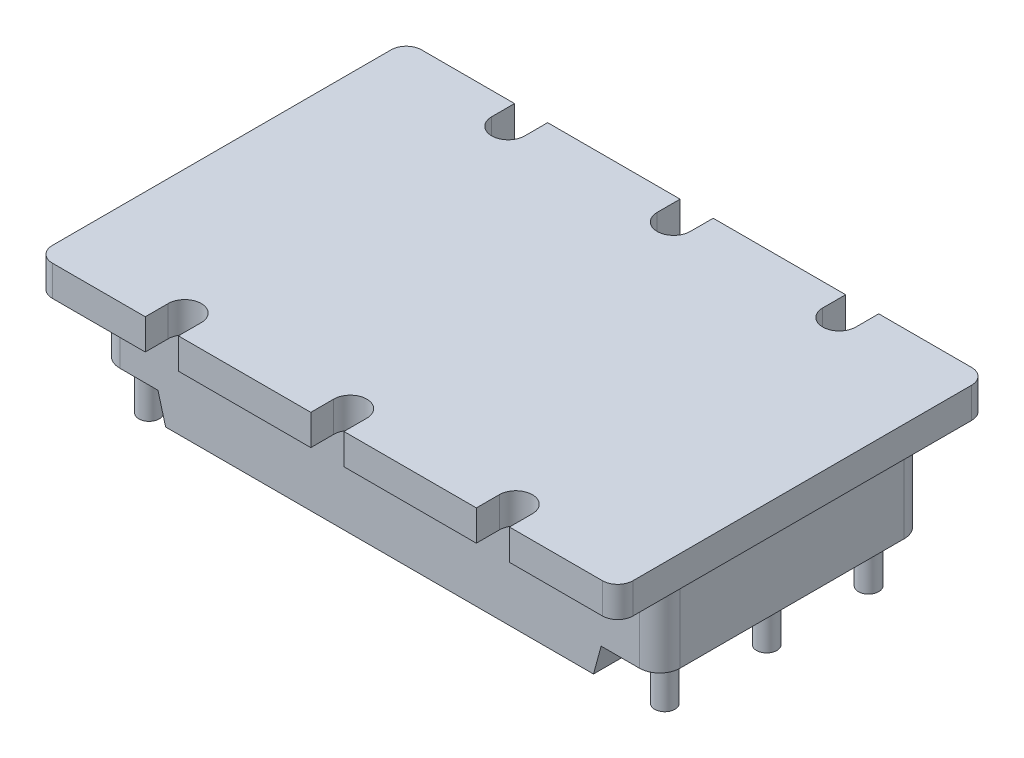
ISO-10303-21;
HEADER;
FILE_DESCRIPTION(('STEP AP214'),'2;1');
FILE_NAME('part.step','',(''),(''),'','','');
FILE_SCHEMA(('AUTOMOTIVE_DESIGN { 1 0 10303 214 1 1 1 1 }'));
ENDSEC;
DATA;
#1=APPLICATION_CONTEXT('core data for automotive mechanical design processes');
#2=APPLICATION_PROTOCOL_DEFINITION('international standard','automotive_design',2000,#1);
#3=PRODUCT_CONTEXT('',#1,'mechanical');
#4=PRODUCT('Part','Part','',(#3));
#5=PRODUCT_RELATED_PRODUCT_CATEGORY('part','',(#4));
#6=PRODUCT_DEFINITION_FORMATION('','',#4);
#7=PRODUCT_DEFINITION_CONTEXT('part definition',#1,'design');
#8=PRODUCT_DEFINITION('design','',#6,#7);
#9=PRODUCT_DEFINITION_SHAPE('','',#8);
#10=(LENGTH_UNIT() NAMED_UNIT(*) SI_UNIT(.MILLI.,.METRE.));
#11=(NAMED_UNIT(*) PLANE_ANGLE_UNIT() SI_UNIT($,.RADIAN.));
#12=(NAMED_UNIT(*) SI_UNIT($,.STERADIAN.) SOLID_ANGLE_UNIT());
#13=UNCERTAINTY_MEASURE_WITH_UNIT(LENGTH_MEASURE(1.E-05),#10,'distance_accuracy_value','');
#14=(GEOMETRIC_REPRESENTATION_CONTEXT(3) GLOBAL_UNCERTAINTY_ASSIGNED_CONTEXT((#13)) GLOBAL_UNIT_ASSIGNED_CONTEXT((#10,
#11,#12)) REPRESENTATION_CONTEXT('',''));
#15=CARTESIAN_POINT('',(0.,0.,0.));
#16=DIRECTION('',(0.,0.,1.));
#17=DIRECTION('',(1.,0.,0.));
#18=AXIS2_PLACEMENT_3D('',#15,#16,#17);
#19=CARTESIAN_POINT('',(53.34,2.794,-3.048));
#20=DIRECTION('',(0.,1.,0.));
#21=DIRECTION('',(-1.,0.,0.));
#22=AXIS2_PLACEMENT_3D('',#19,#20,#21);
#23=PLANE('',#22);
#24=CARTESIAN_POINT('',(50.8,2.794,10.16));
#25=DIRECTION('',(0.,1.,0.));
#26=DIRECTION('',(-1.,0.,0.));
#27=AXIS2_PLACEMENT_3D('',#24,#25,#26);
#28=CIRCLE('',#27,1.016);
#29=CARTESIAN_POINT('',(49.784,2.794,10.16));
#30=VERTEX_POINT('',#29);
#31=EDGE_CURVE('E23',#30,#30,#28,.F.);
#32=ORIENTED_EDGE('',*,*,#31,.F.);
#33=EDGE_LOOP('',(#32));
#34=FACE_BOUND('',#33,.T.);
#35=DIRECTION('',(-1.,0.,0.));
#36=VECTOR('',#35,1.);
#37=CARTESIAN_POINT('',(53.34,2.794,23.368));
#38=LINE('',#37,#36);
#39=CARTESIAN_POINT('',(51.308,2.794,23.368));
#40=VERTEX_POINT('',#39);
#41=CARTESIAN_POINT('',(47.498,2.794,23.368));
#42=VERTEX_POINT('',#41);
#43=EDGE_CURVE('E528',#40,#42,#38,.T.);
#44=ORIENTED_EDGE('',*,*,#43,.T.);
#45=DIRECTION('',(0.,0.,1.));
#46=VECTOR('',#45,1.);
#47=CARTESIAN_POINT('',(47.498,2.794,-3.048));
#48=LINE('',#47,#46);
#49=CARTESIAN_POINT('',(47.498,2.794,-3.048));
#50=VERTEX_POINT('',#49);
#51=EDGE_CURVE('E543',#50,#42,#48,.T.);
#52=ORIENTED_EDGE('',*,*,#51,.F.);
#53=DIRECTION('',(-1.,0.,0.));
#54=VECTOR('',#53,1.);
#55=CARTESIAN_POINT('',(53.34,2.794,-3.048));
#56=LINE('',#55,#54);
#57=CARTESIAN_POINT('',(51.308,2.794,-3.048));
#58=VERTEX_POINT('',#57);
#59=EDGE_CURVE('E532',#58,#50,#56,.T.);
#60=ORIENTED_EDGE('',*,*,#59,.F.);
#61=CARTESIAN_POINT('',(51.308,2.794,-1.016));
#62=DIRECTION('',(0.,1.,0.));
#63=DIRECTION('',(-1.,0.,0.));
#64=AXIS2_PLACEMENT_3D('',#61,#62,#63);
#65=CIRCLE('',#64,2.032);
#66=CARTESIAN_POINT('',(53.34,2.794,-1.016));
#67=VERTEX_POINT('',#66);
#68=EDGE_CURVE('E542',#67,#58,#65,.T.);
#69=ORIENTED_EDGE('',*,*,#68,.F.);
#70=DIRECTION('',(0.,0.,1.));
#71=VECTOR('',#70,1.);
#72=CARTESIAN_POINT('',(53.34,2.794,-3.048));
#73=LINE('',#72,#71);
#74=CARTESIAN_POINT('',(53.34,2.794,21.336));
#75=VERTEX_POINT('',#74);
#76=EDGE_CURVE('E538',#67,#75,#73,.T.);
#77=ORIENTED_EDGE('',*,*,#76,.T.);
#78=CARTESIAN_POINT('',(51.308,2.794,21.336));
#79=DIRECTION('',(0.,1.,0.));
#80=DIRECTION('',(-1.,0.,0.));
#81=AXIS2_PLACEMENT_3D('',#78,#79,#80);
#82=CIRCLE('',#81,2.032);
#83=EDGE_CURVE('E549',#40,#75,#82,.T.);
#84=ORIENTED_EDGE('',*,*,#83,.F.);
#85=EDGE_LOOP('',(#44,#52,#60,#69,#77,#84));
#86=FACE_BOUND('',#85,.T.);
#87=CARTESIAN_POINT('',(50.8,2.794,0.));
#88=DIRECTION('',(0.,1.,0.));
#89=DIRECTION('',(-1.,0.,0.));
#90=AXIS2_PLACEMENT_3D('',#87,#88,#89);
#91=CIRCLE('',#90,1.016);
#92=CARTESIAN_POINT('',(49.784,2.794,0.));
#93=VERTEX_POINT('',#92);
#94=EDGE_CURVE('E641',#93,#93,#91,.F.);
#95=ORIENTED_EDGE('',*,*,#94,.F.);
#96=EDGE_LOOP('',(#95));
#97=FACE_BOUND('',#96,.T.);
#98=CARTESIAN_POINT('',(50.8,2.794,20.32));
#99=DIRECTION('',(0.,1.,0.));
#100=DIRECTION('',(-1.,0.,0.));
#101=AXIS2_PLACEMENT_3D('',#98,#99,#100);
#102=CIRCLE('',#101,1.016);
#103=CARTESIAN_POINT('',(49.784,2.794,20.32));
#104=VERTEX_POINT('',#103);
#105=EDGE_CURVE('E10',#104,#104,#102,.F.);
#106=ORIENTED_EDGE('',*,*,#105,.F.);
#107=EDGE_LOOP('',(#106));
#108=FACE_BOUND('',#107,.T.);
#109=ADVANCED_FACE('F15',(#34,#86,#97,#108),#23,.F.);
#110=CARTESIAN_POINT('',(-2.54,2.794,-3.048));
#111=DIRECTION('',(0.,1.,0.));
#112=DIRECTION('',(-1.,0.,0.));
#113=AXIS2_PLACEMENT_3D('',#110,#111,#112);
#114=PLANE('',#113);
#115=CARTESIAN_POINT('',(0.,2.794,13.97));
#116=DIRECTION('',(0.,1.,0.));
#117=DIRECTION('',(-1.,0.,0.));
#118=AXIS2_PLACEMENT_3D('',#115,#116,#117);
#119=CIRCLE('',#118,1.016);
#120=CARTESIAN_POINT('',(-1.016,2.794,13.97));
#121=VERTEX_POINT('',#120);
#122=EDGE_CURVE('E635',#121,#121,#119,.F.);
#123=ORIENTED_EDGE('',*,*,#122,.F.);
#124=EDGE_LOOP('',(#123));
#125=FACE_BOUND('',#124,.T.);
#126=CARTESIAN_POINT('',(0.,2.794,0.));
#127=DIRECTION('',(0.,1.,0.));
#128=DIRECTION('',(-1.,0.,0.));
#129=AXIS2_PLACEMENT_3D('',#126,#127,#128);
#130=CIRCLE('',#129,1.016);
#131=CARTESIAN_POINT('',(-1.016,2.794,0.));
#132=VERTEX_POINT('',#131);
#133=EDGE_CURVE('E629',#132,#132,#130,.F.);
#134=ORIENTED_EDGE('',*,*,#133,.F.);
#135=EDGE_LOOP('',(#134));
#136=FACE_BOUND('',#135,.T.);
#137=DIRECTION('',(0.,0.,1.));
#138=VECTOR('',#137,1.);
#139=CARTESIAN_POINT('',(-2.54,2.794,-3.048));
#140=LINE('',#139,#138);
#141=CARTESIAN_POINT('',(-2.54,2.794,-1.016));
#142=VERTEX_POINT('',#141);
#143=CARTESIAN_POINT('',(-2.54,2.794,21.336));
#144=VERTEX_POINT('',#143);
#145=EDGE_CURVE('E564',#142,#144,#140,.T.);
#146=ORIENTED_EDGE('',*,*,#145,.F.);
#147=CARTESIAN_POINT('',(-0.508,2.794,-1.016));
#148=DIRECTION('',(0.,1.,0.));
#149=DIRECTION('',(-1.,0.,0.));
#150=AXIS2_PLACEMENT_3D('',#147,#148,#149);
#151=CIRCLE('',#150,2.032);
#152=CARTESIAN_POINT('',(-0.508,2.794,-3.048));
#153=VERTEX_POINT('',#152);
#154=EDGE_CURVE('E567',#153,#142,#151,.T.);
#155=ORIENTED_EDGE('',*,*,#154,.F.);
#156=DIRECTION('',(-1.,0.,0.));
#157=VECTOR('',#156,1.);
#158=CARTESIAN_POINT('',(-2.54,2.794,-3.048));
#159=LINE('',#158,#157);
#160=CARTESIAN_POINT('',(3.302,2.794,-3.048));
#161=VERTEX_POINT('',#160);
#162=EDGE_CURVE('E560',#161,#153,#159,.T.);
#163=ORIENTED_EDGE('',*,*,#162,.F.);
#164=DIRECTION('',(0.,0.,1.));
#165=VECTOR('',#164,1.);
#166=CARTESIAN_POINT('',(3.302,2.794,-3.048));
#167=LINE('',#166,#165);
#168=CARTESIAN_POINT('',(3.302,2.794,23.368));
#169=VERTEX_POINT('',#168);
#170=EDGE_CURVE('E568',#161,#169,#167,.T.);
#171=ORIENTED_EDGE('',*,*,#170,.T.);
#172=DIRECTION('',(-1.,0.,0.));
#173=VECTOR('',#172,1.);
#174=CARTESIAN_POINT('',(-2.54,2.794,23.368));
#175=LINE('',#174,#173);
#176=CARTESIAN_POINT('',(-0.508,2.794,23.368));
#177=VERTEX_POINT('',#176);
#178=EDGE_CURVE('E555',#169,#177,#175,.T.);
#179=ORIENTED_EDGE('',*,*,#178,.T.);
#180=CARTESIAN_POINT('',(-0.508,2.794,21.336));
#181=DIRECTION('',(0.,1.,0.));
#182=DIRECTION('',(-1.,0.,0.));
#183=AXIS2_PLACEMENT_3D('',#180,#181,#182);
#184=CIRCLE('',#183,2.032);
#185=EDGE_CURVE('E573',#144,#177,#184,.T.);
#186=ORIENTED_EDGE('',*,*,#185,.F.);
#187=EDGE_LOOP('',(#146,#155,#163,#171,#179,#186));
#188=FACE_BOUND('',#187,.T.);
#189=CARTESIAN_POINT('',(0.,2.794,6.985));
#190=DIRECTION('',(0.,1.,0.));
#191=DIRECTION('',(-1.,0.,0.));
#192=AXIS2_PLACEMENT_3D('',#189,#190,#191);
#193=CIRCLE('',#192,1.016);
#194=CARTESIAN_POINT('',(-1.016,2.794,6.985));
#195=VERTEX_POINT('',#194);
#196=EDGE_CURVE('E632',#195,#195,#193,.F.);
#197=ORIENTED_EDGE('',*,*,#196,.F.);
#198=EDGE_LOOP('',(#197));
#199=FACE_BOUND('',#198,.T.);
#200=CARTESIAN_POINT('',(0.,2.794,20.955));
#201=DIRECTION('',(0.,1.,0.));
#202=DIRECTION('',(-1.,0.,0.));
#203=AXIS2_PLACEMENT_3D('',#200,#201,#202);
#204=CIRCLE('',#203,1.016);
#205=CARTESIAN_POINT('',(-1.01599999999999,2.794,20.955));
#206=VERTEX_POINT('',#205);
#207=EDGE_CURVE('E638',#206,#206,#204,.F.);
#208=ORIENTED_EDGE('',*,*,#207,.F.);
#209=EDGE_LOOP('',(#208));
#210=FACE_BOUND('',#209,.T.);
#211=ADVANCED_FACE('F650',(#125,#136,#188,#199,#210),#114,.F.);
#212=CARTESIAN_POINT('',(-2.032,13.716,28.575));
#213=DIRECTION('',(0.,0.,-1.));
#214=DIRECTION('',(-1.,0.,0.));
#215=AXIS2_PLACEMENT_3D('',#212,#213,#214);
#216=PLANE('',#215);
#217=DIRECTION('',(1.,0.,0.));
#218=VECTOR('',#217,1.);
#219=CARTESIAN_POINT('',(-2.032,13.716,28.575));
#220=LINE('',#219,#218);
#221=CARTESIAN_POINT('',(10.541,13.716,28.575));
#222=VERTEX_POINT('',#221);
#223=CARTESIAN_POINT('',(23.749,13.716,28.575));
#224=VERTEX_POINT('',#223);
#225=EDGE_CURVE('E489',#222,#224,#220,.T.);
#226=ORIENTED_EDGE('',*,*,#225,.F.);
#227=DIRECTION('',(0.,1.,0.));
#228=VECTOR('',#227,1.);
#229=CARTESIAN_POINT('',(10.541,-0.000999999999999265,28.575));
#230=LINE('',#229,#228);
#231=CARTESIAN_POINT('',(10.541,10.668,28.575));
#232=VERTEX_POINT('',#231);
#233=EDGE_CURVE('E332',#232,#222,#230,.T.);
#234=ORIENTED_EDGE('',*,*,#233,.F.);
#235=DIRECTION('',(1.,0.,0.));
#236=VECTOR('',#235,1.);
#237=CARTESIAN_POINT('',(-2.032,10.668,28.575));
#238=LINE('',#237,#236);
#239=CARTESIAN_POINT('',(23.749,10.668,28.575));
#240=VERTEX_POINT('',#239);
#241=EDGE_CURVE('E466',#232,#240,#238,.T.);
#242=ORIENTED_EDGE('',*,*,#241,.T.);
#243=DIRECTION('',(0.,1.,0.));
#244=VECTOR('',#243,1.);
#245=CARTESIAN_POINT('',(23.749,-0.000999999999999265,28.575));
#246=LINE('',#245,#244);
#247=EDGE_CURVE('E376',#240,#224,#246,.T.);
#248=ORIENTED_EDGE('',*,*,#247,.T.);
#249=EDGE_LOOP('',(#226,#234,#242,#248));
#250=FACE_BOUND('',#249,.T.);
#251=ADVANCED_FACE('F823',(#250),#216,.F.);
#252=CARTESIAN_POINT('',(-2.032,13.716,-8.255));
#253=DIRECTION('',(0.,0.,1.));
#254=DIRECTION('',(1.,0.,0.));
#255=AXIS2_PLACEMENT_3D('',#252,#253,#254);
#256=PLANE('',#255);
#257=DIRECTION('',(-1.,0.,0.));
#258=VECTOR('',#257,1.);
#259=CARTESIAN_POINT('',(-2.032,13.716,-8.255));
#260=LINE('',#259,#258);
#261=CARTESIAN_POINT('',(7.239,13.716,-8.255));
#262=VERTEX_POINT('',#261);
#263=CARTESIAN_POINT('',(-2.032,13.716,-8.255));
#264=VERTEX_POINT('',#263);
#265=EDGE_CURVE('E495',#262,#264,#260,.T.);
#266=ORIENTED_EDGE('',*,*,#265,.F.);
#267=DIRECTION('',(0.,1.,0.));
#268=VECTOR('',#267,1.);
#269=CARTESIAN_POINT('',(7.239,-0.000999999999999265,-8.255));
#270=LINE('',#269,#268);
#271=CARTESIAN_POINT('',(7.239,10.668,-8.255));
#272=VERTEX_POINT('',#271);
#273=EDGE_CURVE('E349',#272,#262,#270,.T.);
#274=ORIENTED_EDGE('',*,*,#273,.F.);
#275=DIRECTION('',(-1.,0.,0.));
#276=VECTOR('',#275,1.);
#277=CARTESIAN_POINT('',(-2.032,10.668,-8.255));
#278=LINE('',#277,#276);
#279=CARTESIAN_POINT('',(-2.032,10.668,-8.255));
#280=VERTEX_POINT('',#279);
#281=EDGE_CURVE('E472',#272,#280,#278,.T.);
#282=ORIENTED_EDGE('',*,*,#281,.T.);
#283=DIRECTION('',(0.,-1.,0.));
#284=VECTOR('',#283,1.);
#285=CARTESIAN_POINT('',(-2.032,13.716,-8.255));
#286=LINE('',#285,#284);
#287=EDGE_CURVE('E510',#264,#280,#286,.T.);
#288=ORIENTED_EDGE('',*,*,#287,.F.);
#289=EDGE_LOOP('',(#266,#274,#282,#288));
#290=FACE_BOUND('',#289,.T.);
#291=ADVANCED_FACE('F806',(#290),#256,.F.);
#292=CARTESIAN_POINT('',(27.051,13.716,28.575));
#293=VERTEX_POINT('',#292);
#294=CARTESIAN_POINT('',(40.259,13.716,28.575));
#295=VERTEX_POINT('',#294);
#296=EDGE_CURVE('E963',#293,#295,#220,.T.);
#297=ORIENTED_EDGE('',*,*,#296,.F.);
#298=DIRECTION('',(0.,1.,0.));
#299=VECTOR('',#298,1.);
#300=CARTESIAN_POINT('',(27.051,-0.000999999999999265,28.575));
#301=LINE('',#300,#299);
#302=CARTESIAN_POINT('',(27.051,10.668,28.575));
#303=VERTEX_POINT('',#302);
#304=EDGE_CURVE('E374',#303,#293,#301,.T.);
#305=ORIENTED_EDGE('',*,*,#304,.F.);
#306=CARTESIAN_POINT('',(40.259,10.668,28.575));
#307=VERTEX_POINT('',#306);
#308=EDGE_CURVE('E989',#303,#307,#238,.T.);
#309=ORIENTED_EDGE('',*,*,#308,.T.);
#310=DIRECTION('',(0.,1.,0.));
#311=VECTOR('',#310,1.);
#312=CARTESIAN_POINT('',(40.259,-0.000999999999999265,28.575));
#313=LINE('',#312,#311);
#314=EDGE_CURVE('E427',#307,#295,#313,.T.);
#315=ORIENTED_EDGE('',*,*,#314,.T.);
#316=EDGE_LOOP('',(#297,#305,#309,#315));
#317=FACE_BOUND('',#316,.T.);
#318=ADVANCED_FACE('F906',(#317),#216,.F.);
#319=CARTESIAN_POINT('',(23.749,10.668,-8.255));
#320=VERTEX_POINT('',#319);
#321=CARTESIAN_POINT('',(10.541,10.668,-8.255));
#322=VERTEX_POINT('',#321);
#323=EDGE_CURVE('E947',#320,#322,#278,.T.);
#324=ORIENTED_EDGE('',*,*,#323,.T.);
#325=DIRECTION('',(0.,1.,0.));
#326=VECTOR('',#325,1.);
#327=CARTESIAN_POINT('',(10.541,-0.000999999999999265,-8.255));
#328=LINE('',#327,#326);
#329=CARTESIAN_POINT('',(10.541,13.716,-8.255));
#330=VERTEX_POINT('',#329);
#331=EDGE_CURVE('E351',#322,#330,#328,.T.);
#332=ORIENTED_EDGE('',*,*,#331,.T.);
#333=CARTESIAN_POINT('',(23.749,13.716,-8.255));
#334=VERTEX_POINT('',#333);
#335=EDGE_CURVE('E927',#334,#330,#260,.T.);
#336=ORIENTED_EDGE('',*,*,#335,.F.);
#337=DIRECTION('',(0.,1.,0.));
#338=VECTOR('',#337,1.);
#339=CARTESIAN_POINT('',(23.749,-0.000999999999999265,-8.255));
#340=LINE('',#339,#338);
#341=EDGE_CURVE('E399',#320,#334,#340,.T.);
#342=ORIENTED_EDGE('',*,*,#341,.F.);
#343=EDGE_LOOP('',(#324,#332,#336,#342));
#344=FACE_BOUND('',#343,.T.);
#345=ADVANCED_FACE('F901',(#344),#256,.F.);
#346=CARTESIAN_POINT('',(43.561,13.716,28.575));
#347=VERTEX_POINT('',#346);
#348=CARTESIAN_POINT('',(52.832,13.716,28.575));
#349=VERTEX_POINT('',#348);
#350=EDGE_CURVE('E484',#347,#349,#220,.T.);
#351=ORIENTED_EDGE('',*,*,#350,.F.);
#352=DIRECTION('',(0.,1.,0.));
#353=VECTOR('',#352,1.);
#354=CARTESIAN_POINT('',(43.561,-0.000999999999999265,28.575));
#355=LINE('',#354,#353);
#356=CARTESIAN_POINT('',(43.561,10.668,28.575));
#357=VERTEX_POINT('',#356);
#358=EDGE_CURVE('E425',#357,#347,#355,.T.);
#359=ORIENTED_EDGE('',*,*,#358,.F.);
#360=CARTESIAN_POINT('',(52.832,10.668,28.575));
#361=VERTEX_POINT('',#360);
#362=EDGE_CURVE('E462',#357,#361,#238,.T.);
#363=ORIENTED_EDGE('',*,*,#362,.T.);
#364=DIRECTION('',(0.,-1.,0.));
#365=VECTOR('',#364,1.);
#366=CARTESIAN_POINT('',(52.832,13.716,28.575));
#367=LINE('',#366,#365);
#368=EDGE_CURVE('E522',#349,#361,#367,.T.);
#369=ORIENTED_EDGE('',*,*,#368,.F.);
#370=EDGE_LOOP('',(#351,#359,#363,#369));
#371=FACE_BOUND('',#370,.T.);
#372=ADVANCED_FACE('F824',(#371),#216,.F.);
#373=CARTESIAN_POINT('',(40.259,10.668,-8.255));
#374=VERTEX_POINT('',#373);
#375=CARTESIAN_POINT('',(27.051,10.668,-8.255));
#376=VERTEX_POINT('',#375);
#377=EDGE_CURVE('E477',#374,#376,#278,.T.);
#378=ORIENTED_EDGE('',*,*,#377,.T.);
#379=DIRECTION('',(0.,1.,0.));
#380=VECTOR('',#379,1.);
#381=CARTESIAN_POINT('',(27.051,-0.000999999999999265,-8.255));
#382=LINE('',#381,#380);
#383=CARTESIAN_POINT('',(27.051,13.716,-8.255));
#384=VERTEX_POINT('',#383);
#385=EDGE_CURVE('E401',#376,#384,#382,.T.);
#386=ORIENTED_EDGE('',*,*,#385,.T.);
#387=CARTESIAN_POINT('',(40.259,13.716,-8.255));
#388=VERTEX_POINT('',#387);
#389=EDGE_CURVE('E500',#388,#384,#260,.T.);
#390=ORIENTED_EDGE('',*,*,#389,.F.);
#391=DIRECTION('',(0.,1.,0.));
#392=VECTOR('',#391,1.);
#393=CARTESIAN_POINT('',(40.259,-0.000999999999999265,-8.255));
#394=LINE('',#393,#392);
#395=EDGE_CURVE('E450',#374,#388,#394,.T.);
#396=ORIENTED_EDGE('',*,*,#395,.F.);
#397=EDGE_LOOP('',(#378,#386,#390,#396));
#398=FACE_BOUND('',#397,.T.);
#399=ADVANCED_FACE('F807',(#398),#256,.F.);
#400=CARTESIAN_POINT('',(-0.508,10.668,21.336));
#401=DIRECTION('',(0.,-1.,0.));
#402=DIRECTION('',(0.,0.,-1.));
#403=AXIS2_PLACEMENT_3D('',#400,#401,#402);
#404=CYLINDRICAL_SURFACE('',#403,2.032);
#405=DIRECTION('',(0.,-1.,0.));
#406=VECTOR('',#405,1.);
#407=CARTESIAN_POINT('',(-2.54,10.668,21.336));
#408=LINE('',#407,#406);
#409=CARTESIAN_POINT('',(-2.54,10.668,21.336));
#410=VERTEX_POINT('',#409);
#411=EDGE_CURVE('E605',#410,#144,#408,.T.);
#412=ORIENTED_EDGE('',*,*,#411,.T.);
#413=ORIENTED_EDGE('',*,*,#185,.T.);
#414=DIRECTION('',(0.,-1.,0.));
#415=VECTOR('',#414,1.);
#416=CARTESIAN_POINT('',(-0.508,10.668,23.368));
#417=LINE('',#416,#415);
#418=CARTESIAN_POINT('',(-0.508,10.668,23.368));
#419=VERTEX_POINT('',#418);
#420=EDGE_CURVE('E626',#419,#177,#417,.T.);
#421=ORIENTED_EDGE('',*,*,#420,.F.);
#422=CARTESIAN_POINT('',(-0.508,10.668,21.336));
#423=DIRECTION('',(0.,1.,0.));
#424=DIRECTION('',(0.,0.,1.));
#425=AXIS2_PLACEMENT_3D('',#422,#423,#424);
#426=CIRCLE('',#425,2.032);
#427=EDGE_CURVE('E581',#410,#419,#426,.T.);
#428=ORIENTED_EDGE('',*,*,#427,.F.);
#429=EDGE_LOOP('',(#412,#413,#421,#428));
#430=FACE_BOUND('',#429,.T.);
#431=ADVANCED_FACE('F17',(#430),#404,.T.);
#432=CARTESIAN_POINT('',(-0.508,10.668,23.368));
#433=DIRECTION('',(0.,0.,-1.));
#434=DIRECTION('',(-1.,0.,0.));
#435=AXIS2_PLACEMENT_3D('',#432,#433,#434);
#436=PLANE('',#435);
#437=DIRECTION('',(1.,0.,0.));
#438=VECTOR('',#437,1.);
#439=CARTESIAN_POINT('',(-0.508,0.,23.368));
#440=LINE('',#439,#438);
#441=CARTESIAN_POINT('',(4.064,0.,23.368));
#442=VERTEX_POINT('',#441);
#443=CARTESIAN_POINT('',(46.736,0.,23.368));
#444=VERTEX_POINT('',#443);
#445=EDGE_CURVE('E576',#442,#444,#440,.T.);
#446=ORIENTED_EDGE('',*,*,#445,.T.);
#447=DIRECTION('',(-0.263117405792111,-0.964763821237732,0.));
#448=VECTOR('',#447,1.);
#449=CARTESIAN_POINT('',(47.498,2.794,23.368));
#450=LINE('',#449,#448);
#451=EDGE_CURVE('E530',#42,#444,#450,.T.);
#452=ORIENTED_EDGE('',*,*,#451,.F.);
#453=ORIENTED_EDGE('',*,*,#43,.F.);
#454=DIRECTION('',(0.,-1.,0.));
#455=VECTOR('',#454,1.);
#456=CARTESIAN_POINT('',(51.308,10.668,23.368));
#457=LINE('',#456,#455);
#458=CARTESIAN_POINT('',(51.308,10.668,23.368));
#459=VERTEX_POINT('',#458);
#460=EDGE_CURVE('E623',#459,#40,#457,.T.);
#461=ORIENTED_EDGE('',*,*,#460,.F.);
#462=DIRECTION('',(1.,0.,0.));
#463=VECTOR('',#462,1.);
#464=CARTESIAN_POINT('',(-0.508,10.668,23.368));
#465=LINE('',#464,#463);
#466=EDGE_CURVE('E584',#419,#459,#465,.T.);
#467=ORIENTED_EDGE('',*,*,#466,.F.);
#468=ORIENTED_EDGE('',*,*,#420,.T.);
#469=ORIENTED_EDGE('',*,*,#178,.F.);
#470=DIRECTION('',(-0.263117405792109,0.964763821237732,0.));
#471=VECTOR('',#470,1.);
#472=CARTESIAN_POINT('',(3.302,2.794,23.368));
#473=LINE('',#472,#471);
#474=EDGE_CURVE('E552',#442,#169,#473,.T.);
#475=ORIENTED_EDGE('',*,*,#474,.F.);
#476=EDGE_LOOP('',(#446,#452,#453,#461,#467,#468,#469,#475));
#477=FACE_BOUND('',#476,.T.);
#478=ADVANCED_FACE('F864',(#477),#436,.F.);
#479=CARTESIAN_POINT('',(51.308,10.668,21.336));
#480=DIRECTION('',(0.,-1.,0.));
#481=DIRECTION('',(0.,0.,-1.));
#482=AXIS2_PLACEMENT_3D('',#479,#480,#481);
#483=CYLINDRICAL_SURFACE('',#482,2.032);
#484=ORIENTED_EDGE('',*,*,#460,.T.);
#485=ORIENTED_EDGE('',*,*,#83,.T.);
#486=DIRECTION('',(0.,-1.,0.));
#487=VECTOR('',#486,1.);
#488=CARTESIAN_POINT('',(53.34,10.668,21.336));
#489=LINE('',#488,#487);
#490=CARTESIAN_POINT('',(53.34,10.668,21.336));
#491=VERTEX_POINT('',#490);
#492=EDGE_CURVE('E620',#491,#75,#489,.T.);
#493=ORIENTED_EDGE('',*,*,#492,.F.);
#494=CARTESIAN_POINT('',(51.308,10.668,21.336));
#495=DIRECTION('',(0.,1.,0.));
#496=DIRECTION('',(0.,0.,-1.));
#497=AXIS2_PLACEMENT_3D('',#494,#495,#496);
#498=CIRCLE('',#497,2.032);
#499=EDGE_CURVE('E587',#459,#491,#498,.T.);
#500=ORIENTED_EDGE('',*,*,#499,.F.);
#501=EDGE_LOOP('',(#484,#485,#493,#500));
#502=FACE_BOUND('',#501,.T.);
#503=ADVANCED_FACE('F861',(#502),#483,.T.);
#504=CARTESIAN_POINT('',(53.34,10.668,21.336));
#505=DIRECTION('',(-1.,0.,0.));
#506=DIRECTION('',(0.,0.,1.));
#507=AXIS2_PLACEMENT_3D('',#504,#505,#506);
#508=PLANE('',#507);
#509=ORIENTED_EDGE('',*,*,#492,.T.);
#510=ORIENTED_EDGE('',*,*,#76,.F.);
#511=DIRECTION('',(0.,-1.,0.));
#512=VECTOR('',#511,1.);
#513=CARTESIAN_POINT('',(53.34,10.668,-1.016));
#514=LINE('',#513,#512);
#515=CARTESIAN_POINT('',(53.34,10.668,-1.016));
#516=VERTEX_POINT('',#515);
#517=EDGE_CURVE('E617',#516,#67,#514,.T.);
#518=ORIENTED_EDGE('',*,*,#517,.F.);
#519=DIRECTION('',(0.,0.,-1.));
#520=VECTOR('',#519,1.);
#521=CARTESIAN_POINT('',(53.34,10.668,21.336));
#522=LINE('',#521,#520);
#523=EDGE_CURVE('E590',#491,#516,#522,.T.);
#524=ORIENTED_EDGE('',*,*,#523,.F.);
#525=EDGE_LOOP('',(#509,#510,#518,#524));
#526=FACE_BOUND('',#525,.T.);
#527=ADVANCED_FACE('F857',(#526),#508,.F.);
#528=CARTESIAN_POINT('',(51.308,10.668,-1.016));
#529=DIRECTION('',(0.,-1.,0.));
#530=DIRECTION('',(0.,0.,-1.));
#531=AXIS2_PLACEMENT_3D('',#528,#529,#530);
#532=CYLINDRICAL_SURFACE('',#531,2.032);
#533=ORIENTED_EDGE('',*,*,#517,.T.);
#534=ORIENTED_EDGE('',*,*,#68,.T.);
#535=DIRECTION('',(0.,-1.,0.));
#536=VECTOR('',#535,1.);
#537=CARTESIAN_POINT('',(51.308,10.668,-3.048));
#538=LINE('',#537,#536);
#539=CARTESIAN_POINT('',(51.308,10.668,-3.048));
#540=VERTEX_POINT('',#539);
#541=EDGE_CURVE('E614',#540,#58,#538,.T.);
#542=ORIENTED_EDGE('',*,*,#541,.F.);
#543=CARTESIAN_POINT('',(51.308,10.668,-1.016));
#544=DIRECTION('',(0.,1.,0.));
#545=DIRECTION('',(0.,0.,1.));
#546=AXIS2_PLACEMENT_3D('',#543,#544,#545);
#547=CIRCLE('',#546,2.032);
#548=EDGE_CURVE('E593',#516,#540,#547,.T.);
#549=ORIENTED_EDGE('',*,*,#548,.F.);
#550=EDGE_LOOP('',(#533,#534,#542,#549));
#551=FACE_BOUND('',#550,.T.);
#552=ADVANCED_FACE('F853',(#551),#532,.T.);
#553=CARTESIAN_POINT('',(-0.508,10.668,-3.048));
#554=DIRECTION('',(0.,0.,1.));
#555=DIRECTION('',(1.,0.,0.));
#556=AXIS2_PLACEMENT_3D('',#553,#554,#555);
#557=PLANE('',#556);
#558=ORIENTED_EDGE('',*,*,#59,.T.);
#559=DIRECTION('',(-0.263117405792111,-0.964763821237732,0.));
#560=VECTOR('',#559,1.);
#561=CARTESIAN_POINT('',(47.498,2.794,-3.048));
#562=LINE('',#561,#560);
#563=CARTESIAN_POINT('',(46.736,0.,-3.048));
#564=VERTEX_POINT('',#563);
#565=EDGE_CURVE('E535',#50,#564,#562,.T.);
#566=ORIENTED_EDGE('',*,*,#565,.T.);
#567=DIRECTION('',(-1.,0.,0.));
#568=VECTOR('',#567,1.);
#569=CARTESIAN_POINT('',(-0.508,0.,-3.048));
#570=LINE('',#569,#568);
#571=CARTESIAN_POINT('',(4.064,0.,-3.048));
#572=VERTEX_POINT('',#571);
#573=EDGE_CURVE('E579',#564,#572,#570,.T.);
#574=ORIENTED_EDGE('',*,*,#573,.T.);
#575=DIRECTION('',(-0.263117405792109,0.964763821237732,0.));
#576=VECTOR('',#575,1.);
#577=CARTESIAN_POINT('',(3.302,2.794,-3.048));
#578=LINE('',#577,#576);
#579=EDGE_CURVE('E557',#572,#161,#578,.T.);
#580=ORIENTED_EDGE('',*,*,#579,.T.);
#581=ORIENTED_EDGE('',*,*,#162,.T.);
#582=DIRECTION('',(0.,-1.,0.));
#583=VECTOR('',#582,1.);
#584=CARTESIAN_POINT('',(-0.508,10.668,-3.048));
#585=LINE('',#584,#583);
#586=CARTESIAN_POINT('',(-0.508,10.668,-3.048));
#587=VERTEX_POINT('',#586);
#588=EDGE_CURVE('E611',#587,#153,#585,.T.);
#589=ORIENTED_EDGE('',*,*,#588,.F.);
#590=DIRECTION('',(-1.,0.,0.));
#591=VECTOR('',#590,1.);
#592=CARTESIAN_POINT('',(-0.508,10.668,-3.048));
#593=LINE('',#592,#591);
#594=EDGE_CURVE('E596',#540,#587,#593,.T.);
#595=ORIENTED_EDGE('',*,*,#594,.F.);
#596=ORIENTED_EDGE('',*,*,#541,.T.);
#597=EDGE_LOOP('',(#558,#566,#574,#580,#581,#589,#595,#596));
#598=FACE_BOUND('',#597,.T.);
#599=ADVANCED_FACE('F849',(#598),#557,.F.);
#600=CARTESIAN_POINT('',(-0.508,10.668,-1.016));
#601=DIRECTION('',(0.,-1.,0.));
#602=DIRECTION('',(0.,0.,-1.));
#603=AXIS2_PLACEMENT_3D('',#600,#601,#602);
#604=CYLINDRICAL_SURFACE('',#603,2.032);
#605=ORIENTED_EDGE('',*,*,#588,.T.);
#606=ORIENTED_EDGE('',*,*,#154,.T.);
#607=DIRECTION('',(0.,-1.,0.));
#608=VECTOR('',#607,1.);
#609=CARTESIAN_POINT('',(-2.54,10.668,-1.016));
#610=LINE('',#609,#608);
#611=CARTESIAN_POINT('',(-2.54,10.668,-1.016));
#612=VERTEX_POINT('',#611);
#613=EDGE_CURVE('E608',#612,#142,#610,.T.);
#614=ORIENTED_EDGE('',*,*,#613,.F.);
#615=CARTESIAN_POINT('',(-0.508,10.668,-1.016));
#616=DIRECTION('',(0.,1.,0.));
#617=DIRECTION('',(0.,0.,1.));
#618=AXIS2_PLACEMENT_3D('',#615,#616,#617);
#619=CIRCLE('',#618,2.032);
#620=EDGE_CURVE('E599',#587,#612,#619,.T.);
#621=ORIENTED_EDGE('',*,*,#620,.F.);
#622=EDGE_LOOP('',(#605,#606,#614,#621));
#623=FACE_BOUND('',#622,.T.);
#624=ADVANCED_FACE('F845',(#623),#604,.T.);
#625=CARTESIAN_POINT('',(-2.54,10.668,21.336));
#626=DIRECTION('',(1.,0.,0.));
#627=DIRECTION('',(0.,0.,-1.));
#628=AXIS2_PLACEMENT_3D('',#625,#626,#627);
#629=PLANE('',#628);
#630=ORIENTED_EDGE('',*,*,#613,.T.);
#631=ORIENTED_EDGE('',*,*,#145,.T.);
#632=ORIENTED_EDGE('',*,*,#411,.F.);
#633=DIRECTION('',(0.,0.,1.));
#634=VECTOR('',#633,1.);
#635=CARTESIAN_POINT('',(-2.54,10.668,21.336));
#636=LINE('',#635,#634);
#637=EDGE_CURVE('E602',#612,#410,#636,.T.);
#638=ORIENTED_EDGE('',*,*,#637,.F.);
#639=EDGE_LOOP('',(#630,#631,#632,#638));
#640=FACE_BOUND('',#639,.T.);
#641=ADVANCED_FACE('F841',(#640),#629,.F.);
#642=CARTESIAN_POINT('',(-0.508,0.,21.336));
#643=DIRECTION('',(0.,1.,0.));
#644=DIRECTION('',(0.,0.,1.));
#645=AXIS2_PLACEMENT_3D('',#642,#643,#644);
#646=PLANE('',#645);
#647=ORIENTED_EDGE('',*,*,#573,.F.);
#648=DIRECTION('',(0.,0.,1.));
#649=VECTOR('',#648,1.);
#650=CARTESIAN_POINT('',(46.736,0.,-3.048));
#651=LINE('',#650,#649);
#652=EDGE_CURVE('E539',#564,#444,#651,.T.);
#653=ORIENTED_EDGE('',*,*,#652,.T.);
#654=ORIENTED_EDGE('',*,*,#445,.F.);
#655=DIRECTION('',(0.,0.,1.));
#656=VECTOR('',#655,1.);
#657=CARTESIAN_POINT('',(4.064,0.,-3.048));
#658=LINE('',#657,#656);
#659=EDGE_CURVE('E563',#572,#442,#658,.T.);
#660=ORIENTED_EDGE('',*,*,#659,.F.);
#661=EDGE_LOOP('',(#647,#653,#654,#660));
#662=FACE_BOUND('',#661,.T.);
#663=ADVANCED_FACE('F837',(#662),#646,.F.);
#664=CARTESIAN_POINT('',(3.302,2.794,-3.048));
#665=DIRECTION('',(0.964763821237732,0.263117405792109,0.));
#666=DIRECTION('',(-0.263117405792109,0.964763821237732,0.));
#667=AXIS2_PLACEMENT_3D('',#664,#665,#666);
#668=PLANE('',#667);
#669=ORIENTED_EDGE('',*,*,#474,.T.);
#670=ORIENTED_EDGE('',*,*,#170,.F.);
#671=ORIENTED_EDGE('',*,*,#579,.F.);
#672=ORIENTED_EDGE('',*,*,#659,.T.);
#673=EDGE_LOOP('',(#669,#670,#671,#672));
#674=FACE_BOUND('',#673,.T.);
#675=ADVANCED_FACE('F829',(#674),#668,.F.);
#676=CARTESIAN_POINT('',(47.498,2.794,-3.048));
#677=DIRECTION('',(-0.964763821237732,0.263117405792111,0.));
#678=DIRECTION('',(-0.263117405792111,-0.964763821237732,0.));
#679=AXIS2_PLACEMENT_3D('',#676,#677,#678);
#680=PLANE('',#679);
#681=ORIENTED_EDGE('',*,*,#451,.T.);
#682=ORIENTED_EDGE('',*,*,#652,.F.);
#683=ORIENTED_EDGE('',*,*,#565,.F.);
#684=ORIENTED_EDGE('',*,*,#51,.T.);
#685=EDGE_LOOP('',(#681,#682,#683,#684));
#686=FACE_BOUND('',#685,.T.);
#687=ADVANCED_FACE('F789',(#686),#680,.F.);
#688=CARTESIAN_POINT('',(-2.032,10.668,27.051));
#689=DIRECTION('',(0.,1.,0.));
#690=DIRECTION('',(0.,0.,1.));
#691=AXIS2_PLACEMENT_3D('',#688,#689,#690);
#692=PLANE('',#691);
#693=ORIENTED_EDGE('',*,*,#241,.F.);
#694=DIRECTION('',(0.,0.,1.));
#695=VECTOR('',#694,1.);
#696=CARTESIAN_POINT('',(10.541,10.668,26.289));
#697=LINE('',#696,#695);
#698=CARTESIAN_POINT('',(10.541,10.668,26.289));
#699=VERTEX_POINT('',#698);
#700=EDGE_CURVE('E317',#699,#232,#697,.T.);
#701=ORIENTED_EDGE('',*,*,#700,.F.);
#702=CARTESIAN_POINT('',(8.89,10.668,26.289));
#703=DIRECTION('',(0.,1.,0.));
#704=DIRECTION('',(0.,0.,1.));
#705=AXIS2_PLACEMENT_3D('',#702,#703,#704);
#706=CIRCLE('',#705,1.651);
#707=CARTESIAN_POINT('',(7.239,10.668,26.289));
#708=VERTEX_POINT('',#707);
#709=EDGE_CURVE('E298',#708,#699,#706,.F.);
#710=ORIENTED_EDGE('',*,*,#709,.F.);
#711=DIRECTION('',(0.,0.,-1.));
#712=VECTOR('',#711,1.);
#713=CARTESIAN_POINT('',(7.239,10.668,26.289));
#714=LINE('',#713,#712);
#715=CARTESIAN_POINT('',(7.239,10.668,28.575));
#716=VERTEX_POINT('',#715);
#717=EDGE_CURVE('E306',#716,#708,#714,.T.);
#718=ORIENTED_EDGE('',*,*,#717,.F.);
#719=CARTESIAN_POINT('',(-2.032,10.668,28.575));
#720=VERTEX_POINT('',#719);
#721=EDGE_CURVE('E463',#720,#716,#238,.T.);
#722=ORIENTED_EDGE('',*,*,#721,.F.);
#723=CARTESIAN_POINT('',(-2.032,10.668,27.051));
#724=DIRECTION('',(0.,1.,0.));
#725=DIRECTION('',(0.,0.,1.));
#726=AXIS2_PLACEMENT_3D('',#723,#724,#725);
#727=CIRCLE('',#726,1.524);
#728=CARTESIAN_POINT('',(-3.556,10.668,27.051));
#729=VERTEX_POINT('',#728);
#730=EDGE_CURVE('E459',#729,#720,#727,.T.);
#731=ORIENTED_EDGE('',*,*,#730,.F.);
#732=DIRECTION('',(0.,0.,1.));
#733=VECTOR('',#732,1.);
#734=CARTESIAN_POINT('',(-3.556,10.668,27.051));
#735=LINE('',#734,#733);
#736=CARTESIAN_POINT('',(-3.556,10.668,-6.731));
#737=VERTEX_POINT('',#736);
#738=EDGE_CURVE('E479',#737,#729,#735,.T.);
#739=ORIENTED_EDGE('',*,*,#738,.F.);
#740=CARTESIAN_POINT('',(-2.032,10.668,-6.731));
#741=DIRECTION('',(0.,1.,0.));
#742=DIRECTION('',(0.,0.,1.));
#743=AXIS2_PLACEMENT_3D('',#740,#741,#742);
#744=CIRCLE('',#743,1.524);
#745=EDGE_CURVE('E476',#280,#737,#744,.T.);
#746=ORIENTED_EDGE('',*,*,#745,.F.);
#747=ORIENTED_EDGE('',*,*,#281,.F.);
#748=DIRECTION('',(0.,0.,-1.));
#749=VECTOR('',#748,1.);
#750=CARTESIAN_POINT('',(7.239,10.668,-5.969));
#751=LINE('',#750,#749);
#752=CARTESIAN_POINT('',(7.239,10.668,-5.969));
#753=VERTEX_POINT('',#752);
#754=EDGE_CURVE('E337',#753,#272,#751,.T.);
#755=ORIENTED_EDGE('',*,*,#754,.F.);
#756=CARTESIAN_POINT('',(8.89,10.668,-5.969));
#757=DIRECTION('',(0.,1.,0.));
#758=DIRECTION('',(0.,0.,1.));
#759=AXIS2_PLACEMENT_3D('',#756,#757,#758);
#760=CIRCLE('',#759,1.651);
#761=CARTESIAN_POINT('',(10.541,10.668,-5.969));
#762=VERTEX_POINT('',#761);
#763=EDGE_CURVE('E311',#762,#753,#760,.F.);
#764=ORIENTED_EDGE('',*,*,#763,.F.);
#765=DIRECTION('',(0.,0.,1.));
#766=VECTOR('',#765,1.);
#767=CARTESIAN_POINT('',(10.541,10.668,-5.969));
#768=LINE('',#767,#766);
#769=EDGE_CURVE('E348',#322,#762,#768,.T.);
#770=ORIENTED_EDGE('',*,*,#769,.F.);
#771=ORIENTED_EDGE('',*,*,#323,.F.);
#772=DIRECTION('',(0.,0.,-1.));
#773=VECTOR('',#772,1.);
#774=CARTESIAN_POINT('',(23.749,10.668,-5.969));
#775=LINE('',#774,#773);
#776=CARTESIAN_POINT('',(23.749,10.668,-5.969));
#777=VERTEX_POINT('',#776);
#778=EDGE_CURVE('E386',#777,#320,#775,.T.);
#779=ORIENTED_EDGE('',*,*,#778,.F.);
#780=CARTESIAN_POINT('',(25.4,10.668,-5.969));
#781=DIRECTION('',(0.,1.,0.));
#782=DIRECTION('',(0.,0.,1.));
#783=AXIS2_PLACEMENT_3D('',#780,#781,#782);
#784=CIRCLE('',#783,1.651);
#785=CARTESIAN_POINT('',(27.051,10.668,-5.969));
#786=VERTEX_POINT('',#785);
#787=EDGE_CURVE('E383',#786,#777,#784,.F.);
#788=ORIENTED_EDGE('',*,*,#787,.F.);
#789=DIRECTION('',(0.,0.,1.));
#790=VECTOR('',#789,1.);
#791=CARTESIAN_POINT('',(27.051,10.668,-5.969));
#792=LINE('',#791,#790);
#793=EDGE_CURVE('E398',#376,#786,#792,.T.);
#794=ORIENTED_EDGE('',*,*,#793,.F.);
#795=ORIENTED_EDGE('',*,*,#377,.F.);
#796=DIRECTION('',(0.,0.,-1.));
#797=VECTOR('',#796,1.);
#798=CARTESIAN_POINT('',(40.259,10.668,-5.969));
#799=LINE('',#798,#797);
#800=CARTESIAN_POINT('',(40.259,10.668,-5.969));
#801=VERTEX_POINT('',#800);
#802=EDGE_CURVE('E437',#801,#374,#799,.T.);
#803=ORIENTED_EDGE('',*,*,#802,.F.);
#804=CARTESIAN_POINT('',(41.91,10.668,-5.969));
#805=DIRECTION('',(0.,1.,0.));
#806=DIRECTION('',(0.,0.,1.));
#807=AXIS2_PLACEMENT_3D('',#804,#805,#806);
#808=CIRCLE('',#807,1.651);
#809=CARTESIAN_POINT('',(43.561,10.668,-5.969));
#810=VERTEX_POINT('',#809);
#811=EDGE_CURVE('E434',#810,#801,#808,.F.);
#812=ORIENTED_EDGE('',*,*,#811,.F.);
#813=DIRECTION('',(0.,0.,1.));
#814=VECTOR('',#813,1.);
#815=CARTESIAN_POINT('',(43.561,10.668,-5.969));
#816=LINE('',#815,#814);
#817=CARTESIAN_POINT('',(43.561,10.668,-8.255));
#818=VERTEX_POINT('',#817);
#819=EDGE_CURVE('E449',#818,#810,#816,.T.);
#820=ORIENTED_EDGE('',*,*,#819,.F.);
#821=CARTESIAN_POINT('',(52.832,10.668,-8.255));
#822=VERTEX_POINT('',#821);
#823=EDGE_CURVE('E473',#822,#818,#278,.T.);
#824=ORIENTED_EDGE('',*,*,#823,.F.);
#825=CARTESIAN_POINT('',(52.832,10.668,-6.731));
#826=DIRECTION('',(0.,1.,0.));
#827=DIRECTION('',(0.,0.,1.));
#828=AXIS2_PLACEMENT_3D('',#825,#826,#827);
#829=CIRCLE('',#828,1.524);
#830=CARTESIAN_POINT('',(54.356,10.668,-6.731));
#831=VERTEX_POINT('',#830);
#832=EDGE_CURVE('E470',#831,#822,#829,.T.);
#833=ORIENTED_EDGE('',*,*,#832,.F.);
#834=DIRECTION('',(0.,0.,-1.));
#835=VECTOR('',#834,1.);
#836=CARTESIAN_POINT('',(54.356,10.668,27.051));
#837=LINE('',#836,#835);
#838=CARTESIAN_POINT('',(54.356,10.668,27.051));
#839=VERTEX_POINT('',#838);
#840=EDGE_CURVE('E468',#839,#831,#837,.T.);
#841=ORIENTED_EDGE('',*,*,#840,.F.);
#842=CARTESIAN_POINT('',(52.832,10.668,27.051));
#843=DIRECTION('',(0.,1.,0.));
#844=DIRECTION('',(0.,0.,-1.));
#845=AXIS2_PLACEMENT_3D('',#842,#843,#844);
#846=CIRCLE('',#845,1.524);
#847=EDGE_CURVE('E465',#361,#839,#846,.T.);
#848=ORIENTED_EDGE('',*,*,#847,.F.);
#849=ORIENTED_EDGE('',*,*,#362,.F.);
#850=DIRECTION('',(0.,0.,1.));
#851=VECTOR('',#850,1.);
#852=CARTESIAN_POINT('',(43.561,10.668,26.289));
#853=LINE('',#852,#851);
#854=CARTESIAN_POINT('',(43.561,10.668,26.289));
#855=VERTEX_POINT('',#854);
#856=EDGE_CURVE('E411',#855,#357,#853,.T.);
#857=ORIENTED_EDGE('',*,*,#856,.F.);
#858=CARTESIAN_POINT('',(41.91,10.668,26.289));
#859=DIRECTION('',(0.,1.,0.));
#860=DIRECTION('',(0.,0.,1.));
#861=AXIS2_PLACEMENT_3D('',#858,#859,#860);
#862=CIRCLE('',#861,1.651);
#863=CARTESIAN_POINT('',(40.259,10.668,26.289));
#864=VERTEX_POINT('',#863);
#865=EDGE_CURVE('E408',#864,#855,#862,.F.);
#866=ORIENTED_EDGE('',*,*,#865,.F.);
#867=DIRECTION('',(0.,0.,-1.));
#868=VECTOR('',#867,1.);
#869=CARTESIAN_POINT('',(40.259,10.668,26.289));
#870=LINE('',#869,#868);
#871=EDGE_CURVE('E424',#307,#864,#870,.T.);
#872=ORIENTED_EDGE('',*,*,#871,.F.);
#873=ORIENTED_EDGE('',*,*,#308,.F.);
#874=DIRECTION('',(0.,0.,1.));
#875=VECTOR('',#874,1.);
#876=CARTESIAN_POINT('',(27.051,10.668,26.289));
#877=LINE('',#876,#875);
#878=CARTESIAN_POINT('',(27.051,10.668,26.289));
#879=VERTEX_POINT('',#878);
#880=EDGE_CURVE('E360',#879,#303,#877,.T.);
#881=ORIENTED_EDGE('',*,*,#880,.F.);
#882=CARTESIAN_POINT('',(25.4,10.668,26.289));
#883=DIRECTION('',(0.,1.,0.));
#884=DIRECTION('',(0.,0.,1.));
#885=AXIS2_PLACEMENT_3D('',#882,#883,#884);
#886=CIRCLE('',#885,1.651);
#887=CARTESIAN_POINT('',(23.749,10.668,26.289));
#888=VERTEX_POINT('',#887);
#889=EDGE_CURVE('E357',#888,#879,#886,.F.);
#890=ORIENTED_EDGE('',*,*,#889,.F.);
#891=DIRECTION('',(0.,0.,-1.));
#892=VECTOR('',#891,1.);
#893=CARTESIAN_POINT('',(23.749,10.668,26.289));
#894=LINE('',#893,#892);
#895=EDGE_CURVE('E373',#240,#888,#894,.T.);
#896=ORIENTED_EDGE('',*,*,#895,.F.);
#897=EDGE_LOOP('',(#693,#701,#710,#718,#722,#731,#739,#746,#747,#755,#764,#770,#771,#779,#788,
#794,#795,#803,#812,#820,#824,#833,#841,#848,#849,#857,#866,#872,#873,#881,#890,#896));
#898=FACE_BOUND('',#897,.T.);
#899=ORIENTED_EDGE('',*,*,#637,.T.);
#900=ORIENTED_EDGE('',*,*,#427,.T.);
#901=ORIENTED_EDGE('',*,*,#466,.T.);
#902=ORIENTED_EDGE('',*,*,#499,.T.);
#903=ORIENTED_EDGE('',*,*,#523,.T.);
#904=ORIENTED_EDGE('',*,*,#548,.T.);
#905=ORIENTED_EDGE('',*,*,#594,.T.);
#906=ORIENTED_EDGE('',*,*,#620,.T.);
#907=EDGE_LOOP('',(#899,#900,#901,#902,#903,#904,#905,#906));
#908=FACE_BOUND('',#907,.T.);
#909=ADVANCED_FACE('F315',(#898,#908),#692,.F.);
#910=CARTESIAN_POINT('',(-2.032,13.716,27.051));
#911=DIRECTION('',(0.,-1.,0.));
#912=DIRECTION('',(0.,0.,-1.));
#913=AXIS2_PLACEMENT_3D('',#910,#911,#912);
#914=CYLINDRICAL_SURFACE('',#913,1.524);
#915=ORIENTED_EDGE('',*,*,#730,.T.);
#916=DIRECTION('',(0.,-1.,0.));
#917=VECTOR('',#916,1.);
#918=CARTESIAN_POINT('',(-2.032,13.716,28.575));
#919=LINE('',#918,#917);
#920=CARTESIAN_POINT('',(-2.032,13.716,28.575));
#921=VERTEX_POINT('',#920);
#922=EDGE_CURVE('E525',#921,#720,#919,.T.);
#923=ORIENTED_EDGE('',*,*,#922,.F.);
#924=CARTESIAN_POINT('',(-2.032,13.716,27.051));
#925=DIRECTION('',(0.,1.,0.));
#926=DIRECTION('',(0.,0.,1.));
#927=AXIS2_PLACEMENT_3D('',#924,#925,#926);
#928=CIRCLE('',#927,1.524);
#929=CARTESIAN_POINT('',(-3.556,13.716,27.051));
#930=VERTEX_POINT('',#929);
#931=EDGE_CURVE('E481',#930,#921,#928,.T.);
#932=ORIENTED_EDGE('',*,*,#931,.F.);
#933=DIRECTION('',(0.,-1.,0.));
#934=VECTOR('',#933,1.);
#935=CARTESIAN_POINT('',(-3.556,13.716,27.051));
#936=LINE('',#935,#934);
#937=EDGE_CURVE('E504',#930,#729,#936,.T.);
#938=ORIENTED_EDGE('',*,*,#937,.T.);
#939=EDGE_LOOP('',(#915,#923,#932,#938));
#940=FACE_BOUND('',#939,.T.);
#941=ADVANCED_FACE('F788',(#940),#914,.T.);
#942=ORIENTED_EDGE('',*,*,#721,.T.);
#943=DIRECTION('',(0.,1.,0.));
#944=VECTOR('',#943,1.);
#945=CARTESIAN_POINT('',(7.239,-0.000999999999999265,28.575));
#946=LINE('',#945,#944);
#947=CARTESIAN_POINT('',(7.239,13.716,28.575));
#948=VERTEX_POINT('',#947);
#949=EDGE_CURVE('E302',#716,#948,#946,.T.);
#950=ORIENTED_EDGE('',*,*,#949,.T.);
#951=EDGE_CURVE('E485',#921,#948,#220,.T.);
#952=ORIENTED_EDGE('',*,*,#951,.F.);
#953=ORIENTED_EDGE('',*,*,#922,.T.);
#954=EDGE_LOOP('',(#942,#950,#952,#953));
#955=FACE_BOUND('',#954,.T.);
#956=ADVANCED_FACE('F818',(#955),#216,.F.);
#957=CARTESIAN_POINT('',(52.832,13.716,27.051));
#958=DIRECTION('',(0.,-1.,0.));
#959=DIRECTION('',(0.,0.,-1.));
#960=AXIS2_PLACEMENT_3D('',#957,#958,#959);
#961=CYLINDRICAL_SURFACE('',#960,1.524);
#962=ORIENTED_EDGE('',*,*,#847,.T.);
#963=DIRECTION('',(0.,-1.,0.));
#964=VECTOR('',#963,1.);
#965=CARTESIAN_POINT('',(54.356,13.716,27.051));
#966=LINE('',#965,#964);
#967=CARTESIAN_POINT('',(54.356,13.716,27.051));
#968=VERTEX_POINT('',#967);
#969=EDGE_CURVE('E519',#968,#839,#966,.T.);
#970=ORIENTED_EDGE('',*,*,#969,.F.);
#971=CARTESIAN_POINT('',(52.832,13.716,27.051));
#972=DIRECTION('',(0.,1.,0.));
#973=DIRECTION('',(0.,0.,-1.));
#974=AXIS2_PLACEMENT_3D('',#971,#972,#973);
#975=CIRCLE('',#974,1.524);
#976=EDGE_CURVE('E488',#349,#968,#975,.T.);
#977=ORIENTED_EDGE('',*,*,#976,.F.);
#978=ORIENTED_EDGE('',*,*,#368,.T.);
#979=EDGE_LOOP('',(#962,#970,#977,#978));
#980=FACE_BOUND('',#979,.T.);
#981=ADVANCED_FACE('F814',(#980),#961,.T.);
#982=CARTESIAN_POINT('',(54.356,13.716,27.051));
#983=DIRECTION('',(-1.,0.,0.));
#984=DIRECTION('',(0.,0.,1.));
#985=AXIS2_PLACEMENT_3D('',#982,#983,#984);
#986=PLANE('',#985);
#987=ORIENTED_EDGE('',*,*,#840,.T.);
#988=DIRECTION('',(0.,-1.,0.));
#989=VECTOR('',#988,1.);
#990=CARTESIAN_POINT('',(54.356,13.716,-6.731));
#991=LINE('',#990,#989);
#992=CARTESIAN_POINT('',(54.356,13.716,-6.731));
#993=VERTEX_POINT('',#992);
#994=EDGE_CURVE('E516',#993,#831,#991,.T.);
#995=ORIENTED_EDGE('',*,*,#994,.F.);
#996=DIRECTION('',(0.,0.,-1.));
#997=VECTOR('',#996,1.);
#998=CARTESIAN_POINT('',(54.356,13.716,27.051));
#999=LINE('',#998,#997);
#1000=EDGE_CURVE('E491',#968,#993,#999,.T.);
#1001=ORIENTED_EDGE('',*,*,#1000,.F.);
#1002=ORIENTED_EDGE('',*,*,#969,.T.);
#1003=EDGE_LOOP('',(#987,#995,#1001,#1002));
#1004=FACE_BOUND('',#1003,.T.);
#1005=ADVANCED_FACE('F810',(#1004),#986,.F.);
#1006=CARTESIAN_POINT('',(52.832,13.716,-6.731));
#1007=DIRECTION('',(0.,-1.,0.));
#1008=DIRECTION('',(0.,0.,-1.));
#1009=AXIS2_PLACEMENT_3D('',#1006,#1007,#1008);
#1010=CYLINDRICAL_SURFACE('',#1009,1.524);
#1011=ORIENTED_EDGE('',*,*,#832,.T.);
#1012=DIRECTION('',(0.,-1.,0.));
#1013=VECTOR('',#1012,1.);
#1014=CARTESIAN_POINT('',(52.832,13.716,-8.255));
#1015=LINE('',#1014,#1013);
#1016=CARTESIAN_POINT('',(52.832,13.716,-8.255));
#1017=VERTEX_POINT('',#1016);
#1018=EDGE_CURVE('E513',#1017,#822,#1015,.T.);
#1019=ORIENTED_EDGE('',*,*,#1018,.F.);
#1020=CARTESIAN_POINT('',(52.832,13.716,-6.731));
#1021=DIRECTION('',(0.,1.,0.));
#1022=DIRECTION('',(0.,0.,1.));
#1023=AXIS2_PLACEMENT_3D('',#1020,#1021,#1022);
#1024=CIRCLE('',#1023,1.524);
#1025=EDGE_CURVE('E493',#993,#1017,#1024,.T.);
#1026=ORIENTED_EDGE('',*,*,#1025,.F.);
#1027=ORIENTED_EDGE('',*,*,#994,.T.);
#1028=EDGE_LOOP('',(#1011,#1019,#1026,#1027));
#1029=FACE_BOUND('',#1028,.T.);
#1030=ADVANCED_FACE('F804',(#1029),#1010,.T.);
#1031=ORIENTED_EDGE('',*,*,#823,.T.);
#1032=DIRECTION('',(0.,1.,0.));
#1033=VECTOR('',#1032,1.);
#1034=CARTESIAN_POINT('',(43.561,-0.000999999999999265,-8.255));
#1035=LINE('',#1034,#1033);
#1036=CARTESIAN_POINT('',(43.561,13.716,-8.255));
#1037=VERTEX_POINT('',#1036);
#1038=EDGE_CURVE('E452',#818,#1037,#1035,.T.);
#1039=ORIENTED_EDGE('',*,*,#1038,.T.);
#1040=EDGE_CURVE('E496',#1017,#1037,#260,.T.);
#1041=ORIENTED_EDGE('',*,*,#1040,.F.);
#1042=ORIENTED_EDGE('',*,*,#1018,.T.);
#1043=EDGE_LOOP('',(#1031,#1039,#1041,#1042));
#1044=FACE_BOUND('',#1043,.T.);
#1045=ADVANCED_FACE('F800',(#1044),#256,.F.);
#1046=CARTESIAN_POINT('',(-2.032,13.716,-6.731));
#1047=DIRECTION('',(0.,-1.,0.));
#1048=DIRECTION('',(0.,0.,-1.));
#1049=AXIS2_PLACEMENT_3D('',#1046,#1047,#1048);
#1050=CYLINDRICAL_SURFACE('',#1049,1.524);
#1051=ORIENTED_EDGE('',*,*,#745,.T.);
#1052=DIRECTION('',(0.,-1.,0.));
#1053=VECTOR('',#1052,1.);
#1054=CARTESIAN_POINT('',(-3.556,13.716,-6.731));
#1055=LINE('',#1054,#1053);
#1056=CARTESIAN_POINT('',(-3.556,13.716,-6.731));
#1057=VERTEX_POINT('',#1056);
#1058=EDGE_CURVE('E507',#1057,#737,#1055,.T.);
#1059=ORIENTED_EDGE('',*,*,#1058,.F.);
#1060=CARTESIAN_POINT('',(-2.032,13.716,-6.731));
#1061=DIRECTION('',(0.,1.,0.));
#1062=DIRECTION('',(0.,0.,1.));
#1063=AXIS2_PLACEMENT_3D('',#1060,#1061,#1062);
#1064=CIRCLE('',#1063,1.524);
#1065=EDGE_CURVE('E499',#264,#1057,#1064,.T.);
#1066=ORIENTED_EDGE('',*,*,#1065,.F.);
#1067=ORIENTED_EDGE('',*,*,#287,.T.);
#1068=EDGE_LOOP('',(#1051,#1059,#1066,#1067));
#1069=FACE_BOUND('',#1068,.T.);
#1070=ADVANCED_FACE('F796',(#1069),#1050,.T.);
#1071=CARTESIAN_POINT('',(-3.556,13.716,27.051));
#1072=DIRECTION('',(1.,0.,0.));
#1073=DIRECTION('',(0.,0.,-1.));
#1074=AXIS2_PLACEMENT_3D('',#1071,#1072,#1073);
#1075=PLANE('',#1074);
#1076=ORIENTED_EDGE('',*,*,#738,.T.);
#1077=ORIENTED_EDGE('',*,*,#937,.F.);
#1078=DIRECTION('',(0.,0.,1.));
#1079=VECTOR('',#1078,1.);
#1080=CARTESIAN_POINT('',(-3.556,13.716,27.051));
#1081=LINE('',#1080,#1079);
#1082=EDGE_CURVE('E502',#1057,#930,#1081,.T.);
#1083=ORIENTED_EDGE('',*,*,#1082,.F.);
#1084=ORIENTED_EDGE('',*,*,#1058,.T.);
#1085=EDGE_LOOP('',(#1076,#1077,#1083,#1084));
#1086=FACE_BOUND('',#1085,.T.);
#1087=ADVANCED_FACE('F792',(#1086),#1075,.F.);
#1088=CARTESIAN_POINT('',(-2.032,13.716,27.051));
#1089=DIRECTION('',(0.,1.,0.));
#1090=DIRECTION('',(0.,0.,1.));
#1091=AXIS2_PLACEMENT_3D('',#1088,#1089,#1090);
#1092=PLANE('',#1091);
#1093=DIRECTION('',(0.,0.,-1.));
#1094=VECTOR('',#1093,1.);
#1095=CARTESIAN_POINT('',(10.541,13.716,26.289));
#1096=LINE('',#1095,#1094);
#1097=CARTESIAN_POINT('',(10.541,13.716,26.289));
#1098=VERTEX_POINT('',#1097);
#1099=EDGE_CURVE('E303',#222,#1098,#1096,.T.);
#1100=ORIENTED_EDGE('',*,*,#1099,.F.);
#1101=ORIENTED_EDGE('',*,*,#225,.T.);
#1102=DIRECTION('',(0.,0.,1.));
#1103=VECTOR('',#1102,1.);
#1104=CARTESIAN_POINT('',(23.749,13.716,26.289));
#1105=LINE('',#1104,#1103);
#1106=CARTESIAN_POINT('',(23.749,13.716,26.289));
#1107=VERTEX_POINT('',#1106);
#1108=EDGE_CURVE('E364',#1107,#224,#1105,.T.);
#1109=ORIENTED_EDGE('',*,*,#1108,.F.);
#1110=CARTESIAN_POINT('',(25.4,13.716,26.289));
#1111=DIRECTION('',(0.,1.,0.));
#1112=DIRECTION('',(0.,0.,-1.));
#1113=AXIS2_PLACEMENT_3D('',#1110,#1111,#1112);
#1114=CIRCLE('',#1113,1.651);
#1115=CARTESIAN_POINT('',(27.051,13.716,26.289));
#1116=VERTEX_POINT('',#1115);
#1117=EDGE_CURVE('E362',#1116,#1107,#1114,.T.);
#1118=ORIENTED_EDGE('',*,*,#1117,.F.);
#1119=DIRECTION('',(0.,0.,-1.));
#1120=VECTOR('',#1119,1.);
#1121=CARTESIAN_POINT('',(27.051,13.716,26.289));
#1122=LINE('',#1121,#1120);
#1123=EDGE_CURVE('E367',#293,#1116,#1122,.T.);
#1124=ORIENTED_EDGE('',*,*,#1123,.F.);
#1125=ORIENTED_EDGE('',*,*,#296,.T.);
#1126=DIRECTION('',(0.,0.,1.));
#1127=VECTOR('',#1126,1.);
#1128=CARTESIAN_POINT('',(40.259,13.716,26.289));
#1129=LINE('',#1128,#1127);
#1130=CARTESIAN_POINT('',(40.259,13.716,26.289));
#1131=VERTEX_POINT('',#1130);
#1132=EDGE_CURVE('E415',#1131,#295,#1129,.T.);
#1133=ORIENTED_EDGE('',*,*,#1132,.F.);
#1134=CARTESIAN_POINT('',(41.91,13.716,26.289));
#1135=DIRECTION('',(0.,1.,0.));
#1136=DIRECTION('',(0.,0.,-1.));
#1137=AXIS2_PLACEMENT_3D('',#1134,#1135,#1136);
#1138=CIRCLE('',#1137,1.651);
#1139=CARTESIAN_POINT('',(43.561,13.716,26.289));
#1140=VERTEX_POINT('',#1139);
#1141=EDGE_CURVE('E413',#1140,#1131,#1138,.T.);
#1142=ORIENTED_EDGE('',*,*,#1141,.F.);
#1143=DIRECTION('',(0.,0.,-1.));
#1144=VECTOR('',#1143,1.);
#1145=CARTESIAN_POINT('',(43.561,13.716,26.289));
#1146=LINE('',#1145,#1144);
#1147=EDGE_CURVE('E418',#347,#1140,#1146,.T.);
#1148=ORIENTED_EDGE('',*,*,#1147,.F.);
#1149=ORIENTED_EDGE('',*,*,#350,.T.);
#1150=ORIENTED_EDGE('',*,*,#976,.T.);
#1151=ORIENTED_EDGE('',*,*,#1000,.T.);
#1152=ORIENTED_EDGE('',*,*,#1025,.T.);
#1153=ORIENTED_EDGE('',*,*,#1040,.T.);
#1154=DIRECTION('',(0.,0.,-1.));
#1155=VECTOR('',#1154,1.);
#1156=CARTESIAN_POINT('',(43.561,13.716,-5.969));
#1157=LINE('',#1156,#1155);
#1158=CARTESIAN_POINT('',(43.561,13.716,-5.969));
#1159=VERTEX_POINT('',#1158);
#1160=EDGE_CURVE('E441',#1159,#1037,#1157,.T.);
#1161=ORIENTED_EDGE('',*,*,#1160,.F.);
#1162=CARTESIAN_POINT('',(41.91,13.716,-5.969));
#1163=DIRECTION('',(0.,1.,0.));
#1164=DIRECTION('',(0.,0.,1.));
#1165=AXIS2_PLACEMENT_3D('',#1162,#1163,#1164);
#1166=CIRCLE('',#1165,1.651);
#1167=CARTESIAN_POINT('',(40.259,13.716,-5.969));
#1168=VERTEX_POINT('',#1167);
#1169=EDGE_CURVE('E439',#1168,#1159,#1166,.T.);
#1170=ORIENTED_EDGE('',*,*,#1169,.F.);
#1171=DIRECTION('',(0.,0.,1.));
#1172=VECTOR('',#1171,1.);
#1173=CARTESIAN_POINT('',(40.259,13.716,-5.969));
#1174=LINE('',#1173,#1172);
#1175=EDGE_CURVE('E443',#388,#1168,#1174,.T.);
#1176=ORIENTED_EDGE('',*,*,#1175,.F.);
#1177=ORIENTED_EDGE('',*,*,#389,.T.);
#1178=DIRECTION('',(0.,0.,-1.));
#1179=VECTOR('',#1178,1.);
#1180=CARTESIAN_POINT('',(27.051,13.716,-5.969));
#1181=LINE('',#1180,#1179);
#1182=CARTESIAN_POINT('',(27.051,13.716,-5.969));
#1183=VERTEX_POINT('',#1182);
#1184=EDGE_CURVE('E390',#1183,#384,#1181,.T.);
#1185=ORIENTED_EDGE('',*,*,#1184,.F.);
#1186=CARTESIAN_POINT('',(25.4,13.716,-5.969));
#1187=DIRECTION('',(0.,1.,0.));
#1188=DIRECTION('',(0.,0.,1.));
#1189=AXIS2_PLACEMENT_3D('',#1186,#1187,#1188);
#1190=CIRCLE('',#1189,1.651);
#1191=CARTESIAN_POINT('',(23.749,13.716,-5.969));
#1192=VERTEX_POINT('',#1191);
#1193=EDGE_CURVE('E388',#1192,#1183,#1190,.T.);
#1194=ORIENTED_EDGE('',*,*,#1193,.F.);
#1195=DIRECTION('',(0.,0.,1.));
#1196=VECTOR('',#1195,1.);
#1197=CARTESIAN_POINT('',(23.749,13.716,-5.969));
#1198=LINE('',#1197,#1196);
#1199=EDGE_CURVE('E392',#334,#1192,#1198,.T.);
#1200=ORIENTED_EDGE('',*,*,#1199,.F.);
#1201=ORIENTED_EDGE('',*,*,#335,.T.);
#1202=DIRECTION('',(0.,0.,-1.));
#1203=VECTOR('',#1202,1.);
#1204=CARTESIAN_POINT('',(10.541,13.716,-5.969));
#1205=LINE('',#1204,#1203);
#1206=CARTESIAN_POINT('',(10.541,13.716,-5.969));
#1207=VERTEX_POINT('',#1206);
#1208=EDGE_CURVE('E340',#1207,#330,#1205,.T.);
#1209=ORIENTED_EDGE('',*,*,#1208,.F.);
#1210=CARTESIAN_POINT('',(8.89,13.716,-5.969));
#1211=DIRECTION('',(0.,1.,0.));
#1212=DIRECTION('',(0.,0.,1.));
#1213=AXIS2_PLACEMENT_3D('',#1210,#1211,#1212);
#1214=CIRCLE('',#1213,1.651);
#1215=CARTESIAN_POINT('',(7.239,13.716,-5.969));
#1216=VERTEX_POINT('',#1215);
#1217=EDGE_CURVE('E38',#1216,#1207,#1214,.T.);
#1218=ORIENTED_EDGE('',*,*,#1217,.F.);
#1219=DIRECTION('',(0.,0.,1.));
#1220=VECTOR('',#1219,1.);
#1221=CARTESIAN_POINT('',(7.239,13.716,-5.969));
#1222=LINE('',#1221,#1220);
#1223=EDGE_CURVE('E342',#262,#1216,#1222,.T.);
#1224=ORIENTED_EDGE('',*,*,#1223,.F.);
#1225=ORIENTED_EDGE('',*,*,#265,.T.);
#1226=ORIENTED_EDGE('',*,*,#1065,.T.);
#1227=ORIENTED_EDGE('',*,*,#1082,.T.);
#1228=ORIENTED_EDGE('',*,*,#931,.T.);
#1229=ORIENTED_EDGE('',*,*,#951,.T.);
#1230=DIRECTION('',(0.,0.,1.));
#1231=VECTOR('',#1230,1.);
#1232=CARTESIAN_POINT('',(7.239,13.716,26.289));
#1233=LINE('',#1232,#1231);
#1234=CARTESIAN_POINT('',(7.239,13.716,26.289));
#1235=VERTEX_POINT('',#1234);
#1236=EDGE_CURVE('E327',#1235,#948,#1233,.T.);
#1237=ORIENTED_EDGE('',*,*,#1236,.F.);
#1238=CARTESIAN_POINT('',(8.89,13.716,26.289));
#1239=DIRECTION('',(0.,1.,0.));
#1240=DIRECTION('',(0.,0.,-1.));
#1241=AXIS2_PLACEMENT_3D('',#1238,#1239,#1240);
#1242=CIRCLE('',#1241,1.651);
#1243=EDGE_CURVE('E30',#1098,#1235,#1242,.T.);
#1244=ORIENTED_EDGE('',*,*,#1243,.F.);
#1245=EDGE_LOOP('',(#1100,#1101,#1109,#1118,#1124,#1125,#1133,#1142,#1148,#1149,#1150,#1151,
#1152,#1153,#1161,#1170,#1176,#1177,#1185,#1194,#1200,#1201,#1209,#1218,#1224,#1225,#1226,#1227,
#1228,#1229,#1237,#1244));
#1246=FACE_BOUND('',#1245,.T.);
#1247=ADVANCED_FACE('F784',(#1246),#1092,.T.);
#1248=CARTESIAN_POINT('',(41.91,-0.000999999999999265,-5.969));
#1249=DIRECTION('',(0.,1.,0.));
#1250=DIRECTION('',(0.,0.,1.));
#1251=AXIS2_PLACEMENT_3D('',#1248,#1249,#1250);
#1252=CYLINDRICAL_SURFACE('',#1251,1.651);
#1253=ORIENTED_EDGE('',*,*,#811,.T.);
#1254=DIRECTION('',(0.,1.,0.));
#1255=VECTOR('',#1254,1.);
#1256=CARTESIAN_POINT('',(40.259,-0.000999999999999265,-5.969));
#1257=LINE('',#1256,#1255);
#1258=EDGE_CURVE('E447',#801,#1168,#1257,.T.);
#1259=ORIENTED_EDGE('',*,*,#1258,.T.);
#1260=ORIENTED_EDGE('',*,*,#1169,.T.);
#1261=DIRECTION('',(0.,1.,0.));
#1262=VECTOR('',#1261,1.);
#1263=CARTESIAN_POINT('',(43.561,-0.000999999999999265,-5.969));
#1264=LINE('',#1263,#1262);
#1265=EDGE_CURVE('E446',#810,#1159,#1264,.T.);
#1266=ORIENTED_EDGE('',*,*,#1265,.F.);
#1267=EDGE_LOOP('',(#1253,#1259,#1260,#1266));
#1268=FACE_BOUND('',#1267,.T.);
#1269=ADVANCED_FACE('F777',(#1268),#1252,.F.);
#1270=CARTESIAN_POINT('',(40.259,-0.000999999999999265,-5.969));
#1271=DIRECTION('',(-1.,0.,0.));
#1272=DIRECTION('',(0.,0.,1.));
#1273=AXIS2_PLACEMENT_3D('',#1270,#1271,#1272);
#1274=PLANE('',#1273);
#1275=ORIENTED_EDGE('',*,*,#802,.T.);
#1276=ORIENTED_EDGE('',*,*,#395,.T.);
#1277=ORIENTED_EDGE('',*,*,#1175,.T.);
#1278=ORIENTED_EDGE('',*,*,#1258,.F.);
#1279=EDGE_LOOP('',(#1275,#1276,#1277,#1278));
#1280=FACE_BOUND('',#1279,.T.);
#1281=ADVANCED_FACE('F774',(#1280),#1274,.F.);
#1282=CARTESIAN_POINT('',(43.561,-0.000999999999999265,-5.969));
#1283=DIRECTION('',(1.,0.,0.));
#1284=DIRECTION('',(0.,0.,-1.));
#1285=AXIS2_PLACEMENT_3D('',#1282,#1283,#1284);
#1286=PLANE('',#1285);
#1287=ORIENTED_EDGE('',*,*,#819,.T.);
#1288=ORIENTED_EDGE('',*,*,#1265,.T.);
#1289=ORIENTED_EDGE('',*,*,#1160,.T.);
#1290=ORIENTED_EDGE('',*,*,#1038,.F.);
#1291=EDGE_LOOP('',(#1287,#1288,#1289,#1290));
#1292=FACE_BOUND('',#1291,.T.);
#1293=ADVANCED_FACE('F772',(#1292),#1286,.F.);
#1294=CARTESIAN_POINT('',(41.91,-0.000999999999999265,26.289));
#1295=DIRECTION('',(0.,1.,0.));
#1296=DIRECTION('',(0.,0.,1.));
#1297=AXIS2_PLACEMENT_3D('',#1294,#1295,#1296);
#1298=CYLINDRICAL_SURFACE('',#1297,1.651);
#1299=ORIENTED_EDGE('',*,*,#865,.T.);
#1300=DIRECTION('',(0.,1.,0.));
#1301=VECTOR('',#1300,1.);
#1302=CARTESIAN_POINT('',(43.561,-0.000999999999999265,26.289));
#1303=LINE('',#1302,#1301);
#1304=EDGE_CURVE('E422',#855,#1140,#1303,.T.);
#1305=ORIENTED_EDGE('',*,*,#1304,.T.);
#1306=ORIENTED_EDGE('',*,*,#1141,.T.);
#1307=DIRECTION('',(0.,1.,0.));
#1308=VECTOR('',#1307,1.);
#1309=CARTESIAN_POINT('',(40.259,-0.000999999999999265,26.289));
#1310=LINE('',#1309,#1308);
#1311=EDGE_CURVE('E421',#864,#1131,#1310,.T.);
#1312=ORIENTED_EDGE('',*,*,#1311,.F.);
#1313=EDGE_LOOP('',(#1299,#1305,#1306,#1312));
#1314=FACE_BOUND('',#1313,.T.);
#1315=ADVANCED_FACE('F765',(#1314),#1298,.F.);
#1316=CARTESIAN_POINT('',(43.561,-0.000999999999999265,26.289));
#1317=DIRECTION('',(1.,0.,0.));
#1318=DIRECTION('',(0.,0.,-1.));
#1319=AXIS2_PLACEMENT_3D('',#1316,#1317,#1318);
#1320=PLANE('',#1319);
#1321=ORIENTED_EDGE('',*,*,#856,.T.);
#1322=ORIENTED_EDGE('',*,*,#358,.T.);
#1323=ORIENTED_EDGE('',*,*,#1147,.T.);
#1324=ORIENTED_EDGE('',*,*,#1304,.F.);
#1325=EDGE_LOOP('',(#1321,#1322,#1323,#1324));
#1326=FACE_BOUND('',#1325,.T.);
#1327=ADVANCED_FACE('F762',(#1326),#1320,.F.);
#1328=CARTESIAN_POINT('',(40.259,-0.000999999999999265,26.289));
#1329=DIRECTION('',(-1.,0.,0.));
#1330=DIRECTION('',(0.,0.,1.));
#1331=AXIS2_PLACEMENT_3D('',#1328,#1329,#1330);
#1332=PLANE('',#1331);
#1333=ORIENTED_EDGE('',*,*,#871,.T.);
#1334=ORIENTED_EDGE('',*,*,#1311,.T.);
#1335=ORIENTED_EDGE('',*,*,#1132,.T.);
#1336=ORIENTED_EDGE('',*,*,#314,.F.);
#1337=EDGE_LOOP('',(#1333,#1334,#1335,#1336));
#1338=FACE_BOUND('',#1337,.T.);
#1339=ADVANCED_FACE('F760',(#1338),#1332,.F.);
#1340=CARTESIAN_POINT('',(25.4,-0.000999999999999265,-5.969));
#1341=DIRECTION('',(0.,1.,0.));
#1342=DIRECTION('',(0.,0.,1.));
#1343=AXIS2_PLACEMENT_3D('',#1340,#1341,#1342);
#1344=CYLINDRICAL_SURFACE('',#1343,1.651);
#1345=ORIENTED_EDGE('',*,*,#787,.T.);
#1346=DIRECTION('',(0.,1.,0.));
#1347=VECTOR('',#1346,1.);
#1348=CARTESIAN_POINT('',(23.749,-0.000999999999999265,-5.969));
#1349=LINE('',#1348,#1347);
#1350=EDGE_CURVE('E396',#777,#1192,#1349,.T.);
#1351=ORIENTED_EDGE('',*,*,#1350,.T.);
#1352=ORIENTED_EDGE('',*,*,#1193,.T.);
#1353=DIRECTION('',(0.,1.,0.));
#1354=VECTOR('',#1353,1.);
#1355=CARTESIAN_POINT('',(27.051,-0.000999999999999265,-5.969));
#1356=LINE('',#1355,#1354);
#1357=EDGE_CURVE('E395',#786,#1183,#1356,.T.);
#1358=ORIENTED_EDGE('',*,*,#1357,.F.);
#1359=EDGE_LOOP('',(#1345,#1351,#1352,#1358));
#1360=FACE_BOUND('',#1359,.T.);
#1361=ADVANCED_FACE('F753',(#1360),#1344,.F.);
#1362=CARTESIAN_POINT('',(23.749,-0.000999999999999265,-5.969));
#1363=DIRECTION('',(-1.,0.,0.));
#1364=DIRECTION('',(0.,0.,1.));
#1365=AXIS2_PLACEMENT_3D('',#1362,#1363,#1364);
#1366=PLANE('',#1365);
#1367=ORIENTED_EDGE('',*,*,#778,.T.);
#1368=ORIENTED_EDGE('',*,*,#341,.T.);
#1369=ORIENTED_EDGE('',*,*,#1199,.T.);
#1370=ORIENTED_EDGE('',*,*,#1350,.F.);
#1371=EDGE_LOOP('',(#1367,#1368,#1369,#1370));
#1372=FACE_BOUND('',#1371,.T.);
#1373=ADVANCED_FACE('F750',(#1372),#1366,.F.);
#1374=CARTESIAN_POINT('',(27.051,-0.000999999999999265,-5.969));
#1375=DIRECTION('',(1.,0.,0.));
#1376=DIRECTION('',(0.,0.,-1.));
#1377=AXIS2_PLACEMENT_3D('',#1374,#1375,#1376);
#1378=PLANE('',#1377);
#1379=ORIENTED_EDGE('',*,*,#793,.T.);
#1380=ORIENTED_EDGE('',*,*,#1357,.T.);
#1381=ORIENTED_EDGE('',*,*,#1184,.T.);
#1382=ORIENTED_EDGE('',*,*,#385,.F.);
#1383=EDGE_LOOP('',(#1379,#1380,#1381,#1382));
#1384=FACE_BOUND('',#1383,.T.);
#1385=ADVANCED_FACE('F748',(#1384),#1378,.F.);
#1386=CARTESIAN_POINT('',(25.4,-0.000999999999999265,26.289));
#1387=DIRECTION('',(0.,1.,0.));
#1388=DIRECTION('',(0.,0.,1.));
#1389=AXIS2_PLACEMENT_3D('',#1386,#1387,#1388);
#1390=CYLINDRICAL_SURFACE('',#1389,1.651);
#1391=ORIENTED_EDGE('',*,*,#889,.T.);
#1392=DIRECTION('',(0.,1.,0.));
#1393=VECTOR('',#1392,1.);
#1394=CARTESIAN_POINT('',(27.051,-0.000999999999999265,26.289));
#1395=LINE('',#1394,#1393);
#1396=EDGE_CURVE('E371',#879,#1116,#1395,.T.);
#1397=ORIENTED_EDGE('',*,*,#1396,.T.);
#1398=ORIENTED_EDGE('',*,*,#1117,.T.);
#1399=DIRECTION('',(0.,1.,0.));
#1400=VECTOR('',#1399,1.);
#1401=CARTESIAN_POINT('',(23.749,-0.000999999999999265,26.289));
#1402=LINE('',#1401,#1400);
#1403=EDGE_CURVE('E370',#888,#1107,#1402,.T.);
#1404=ORIENTED_EDGE('',*,*,#1403,.F.);
#1405=EDGE_LOOP('',(#1391,#1397,#1398,#1404));
#1406=FACE_BOUND('',#1405,.T.);
#1407=ADVANCED_FACE('F741',(#1406),#1390,.F.);
#1408=CARTESIAN_POINT('',(27.051,-0.000999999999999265,26.289));
#1409=DIRECTION('',(1.,0.,0.));
#1410=DIRECTION('',(0.,0.,-1.));
#1411=AXIS2_PLACEMENT_3D('',#1408,#1409,#1410);
#1412=PLANE('',#1411);
#1413=ORIENTED_EDGE('',*,*,#880,.T.);
#1414=ORIENTED_EDGE('',*,*,#304,.T.);
#1415=ORIENTED_EDGE('',*,*,#1123,.T.);
#1416=ORIENTED_EDGE('',*,*,#1396,.F.);
#1417=EDGE_LOOP('',(#1413,#1414,#1415,#1416));
#1418=FACE_BOUND('',#1417,.T.);
#1419=ADVANCED_FACE('F738',(#1418),#1412,.F.);
#1420=CARTESIAN_POINT('',(23.749,-0.000999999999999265,26.289));
#1421=DIRECTION('',(-1.,0.,0.));
#1422=DIRECTION('',(0.,0.,1.));
#1423=AXIS2_PLACEMENT_3D('',#1420,#1421,#1422);
#1424=PLANE('',#1423);
#1425=ORIENTED_EDGE('',*,*,#895,.T.);
#1426=ORIENTED_EDGE('',*,*,#1403,.T.);
#1427=ORIENTED_EDGE('',*,*,#1108,.T.);
#1428=ORIENTED_EDGE('',*,*,#247,.F.);
#1429=EDGE_LOOP('',(#1425,#1426,#1427,#1428));
#1430=FACE_BOUND('',#1429,.T.);
#1431=ADVANCED_FACE('F737',(#1430),#1424,.F.);
#1432=CARTESIAN_POINT('',(8.89,-0.000999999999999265,-5.969));
#1433=DIRECTION('',(0.,1.,0.));
#1434=DIRECTION('',(0.,0.,1.));
#1435=AXIS2_PLACEMENT_3D('',#1432,#1433,#1434);
#1436=CYLINDRICAL_SURFACE('',#1435,1.651);
#1437=ORIENTED_EDGE('',*,*,#763,.T.);
#1438=DIRECTION('',(0.,1.,0.));
#1439=VECTOR('',#1438,1.);
#1440=CARTESIAN_POINT('',(7.239,-0.000999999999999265,-5.969));
#1441=LINE('',#1440,#1439);
#1442=EDGE_CURVE('E346',#753,#1216,#1441,.T.);
#1443=ORIENTED_EDGE('',*,*,#1442,.T.);
#1444=ORIENTED_EDGE('',*,*,#1217,.T.);
#1445=DIRECTION('',(0.,1.,0.));
#1446=VECTOR('',#1445,1.);
#1447=CARTESIAN_POINT('',(10.541,-0.000999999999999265,-5.969));
#1448=LINE('',#1447,#1446);
#1449=EDGE_CURVE('E345',#762,#1207,#1448,.T.);
#1450=ORIENTED_EDGE('',*,*,#1449,.F.);
#1451=EDGE_LOOP('',(#1437,#1443,#1444,#1450));
#1452=FACE_BOUND('',#1451,.T.);
#1453=ADVANCED_FACE('F730',(#1452),#1436,.F.);
#1454=CARTESIAN_POINT('',(7.239,-0.000999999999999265,-5.969));
#1455=DIRECTION('',(-1.,0.,0.));
#1456=DIRECTION('',(0.,0.,1.));
#1457=AXIS2_PLACEMENT_3D('',#1454,#1455,#1456);
#1458=PLANE('',#1457);
#1459=ORIENTED_EDGE('',*,*,#754,.T.);
#1460=ORIENTED_EDGE('',*,*,#273,.T.);
#1461=ORIENTED_EDGE('',*,*,#1223,.T.);
#1462=ORIENTED_EDGE('',*,*,#1442,.F.);
#1463=EDGE_LOOP('',(#1459,#1460,#1461,#1462));
#1464=FACE_BOUND('',#1463,.T.);
#1465=ADVANCED_FACE('F727',(#1464),#1458,.F.);
#1466=CARTESIAN_POINT('',(10.541,-0.000999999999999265,-5.969));
#1467=DIRECTION('',(1.,0.,0.));
#1468=DIRECTION('',(0.,0.,-1.));
#1469=AXIS2_PLACEMENT_3D('',#1466,#1467,#1468);
#1470=PLANE('',#1469);
#1471=ORIENTED_EDGE('',*,*,#769,.T.);
#1472=ORIENTED_EDGE('',*,*,#1449,.T.);
#1473=ORIENTED_EDGE('',*,*,#1208,.T.);
#1474=ORIENTED_EDGE('',*,*,#331,.F.);
#1475=EDGE_LOOP('',(#1471,#1472,#1473,#1474));
#1476=FACE_BOUND('',#1475,.T.);
#1477=ADVANCED_FACE('F726',(#1476),#1470,.F.);
#1478=CARTESIAN_POINT('',(8.89,-0.000999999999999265,26.289));
#1479=DIRECTION('',(0.,1.,0.));
#1480=DIRECTION('',(0.,0.,1.));
#1481=AXIS2_PLACEMENT_3D('',#1478,#1479,#1480);
#1482=CYLINDRICAL_SURFACE('',#1481,1.651);
#1483=ORIENTED_EDGE('',*,*,#709,.T.);
#1484=DIRECTION('',(0.,1.,0.));
#1485=VECTOR('',#1484,1.);
#1486=CARTESIAN_POINT('',(10.541,-0.000999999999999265,26.289));
#1487=LINE('',#1486,#1485);
#1488=EDGE_CURVE('E312',#699,#1098,#1487,.T.);
#1489=ORIENTED_EDGE('',*,*,#1488,.T.);
#1490=ORIENTED_EDGE('',*,*,#1243,.T.);
#1491=DIRECTION('',(0.,1.,0.));
#1492=VECTOR('',#1491,1.);
#1493=CARTESIAN_POINT('',(7.239,-0.000999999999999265,26.289));
#1494=LINE('',#1493,#1492);
#1495=EDGE_CURVE('E294',#708,#1235,#1494,.T.);
#1496=ORIENTED_EDGE('',*,*,#1495,.F.);
#1497=EDGE_LOOP('',(#1483,#1489,#1490,#1496));
#1498=FACE_BOUND('',#1497,.T.);
#1499=ADVANCED_FACE('F296',(#1498),#1482,.F.);
#1500=CARTESIAN_POINT('',(10.541,-0.000999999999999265,26.289));
#1501=DIRECTION('',(1.,0.,0.));
#1502=DIRECTION('',(0.,0.,-1.));
#1503=AXIS2_PLACEMENT_3D('',#1500,#1501,#1502);
#1504=PLANE('',#1503);
#1505=ORIENTED_EDGE('',*,*,#700,.T.);
#1506=ORIENTED_EDGE('',*,*,#233,.T.);
#1507=ORIENTED_EDGE('',*,*,#1099,.T.);
#1508=ORIENTED_EDGE('',*,*,#1488,.F.);
#1509=EDGE_LOOP('',(#1505,#1506,#1507,#1508));
#1510=FACE_BOUND('',#1509,.T.);
#1511=ADVANCED_FACE('F718',(#1510),#1504,.F.);
#1512=CARTESIAN_POINT('',(7.239,-0.000999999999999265,26.289));
#1513=DIRECTION('',(-1.,0.,0.));
#1514=DIRECTION('',(0.,0.,1.));
#1515=AXIS2_PLACEMENT_3D('',#1512,#1513,#1514);
#1516=PLANE('',#1515);
#1517=ORIENTED_EDGE('',*,*,#717,.T.);
#1518=ORIENTED_EDGE('',*,*,#1495,.T.);
#1519=ORIENTED_EDGE('',*,*,#1236,.T.);
#1520=ORIENTED_EDGE('',*,*,#949,.F.);
#1521=EDGE_LOOP('',(#1517,#1518,#1519,#1520));
#1522=FACE_BOUND('',#1521,.T.);
#1523=ADVANCED_FACE('F307',(#1522),#1516,.F.);
#1524=CARTESIAN_POINT('',(0.,-2.032,0.));
#1525=DIRECTION('',(0.,1.,0.));
#1526=DIRECTION('',(-1.,0.,0.));
#1527=AXIS2_PLACEMENT_3D('',#1524,#1525,#1526);
#1528=CYLINDRICAL_SURFACE('',#1527,1.016);
#1529=CARTESIAN_POINT('',(0.,-2.032,0.));
#1530=DIRECTION('',(0.,-1.,0.));
#1531=DIRECTION('',(1.,0.,0.));
#1532=AXIS2_PLACEMENT_3D('',#1529,#1530,#1531);
#1533=CIRCLE('',#1532,1.016);
#1534=CARTESIAN_POINT('',(1.016,-2.032,0.));
#1535=VERTEX_POINT('',#1534);
#1536=EDGE_CURVE('E318',#1535,#1535,#1533,.T.);
#1537=ORIENTED_EDGE('',*,*,#1536,.F.);
#1538=EDGE_LOOP('',(#1537));
#1539=FACE_BOUND('',#1538,.T.);
#1540=ORIENTED_EDGE('',*,*,#133,.T.);
#1541=EDGE_LOOP('',(#1540));
#1542=FACE_BOUND('',#1541,.T.);
#1543=ADVANCED_FACE('F713',(#1539,#1542),#1528,.T.);
#1544=CARTESIAN_POINT('',(0.,-2.032,0.));
#1545=DIRECTION('',(0.,-1.,0.));
#1546=DIRECTION('',(1.,0.,0.));
#1547=AXIS2_PLACEMENT_3D('',#1544,#1545,#1546);
#1548=PLANE('',#1547);
#1549=ORIENTED_EDGE('',*,*,#1536,.T.);
#1550=EDGE_LOOP('',(#1549));
#1551=FACE_BOUND('',#1550,.T.);
#1552=ADVANCED_FACE('F709',(#1551),#1548,.T.);
#1553=CARTESIAN_POINT('',(0.,-2.032,6.985));
#1554=DIRECTION('',(0.,1.,0.));
#1555=DIRECTION('',(-1.,0.,0.));
#1556=AXIS2_PLACEMENT_3D('',#1553,#1554,#1555);
#1557=CYLINDRICAL_SURFACE('',#1556,1.016);
#1558=CARTESIAN_POINT('',(0.,-2.032,6.985));
#1559=DIRECTION('',(0.,-1.,0.));
#1560=DIRECTION('',(1.,0.,0.));
#1561=AXIS2_PLACEMENT_3D('',#1558,#1559,#1560);
#1562=CIRCLE('',#1561,1.016);
#1563=CARTESIAN_POINT('',(1.016,-2.032,6.985));
#1564=VERTEX_POINT('',#1563);
#1565=EDGE_CURVE('E322',#1564,#1564,#1562,.T.);
#1566=ORIENTED_EDGE('',*,*,#1565,.F.);
#1567=EDGE_LOOP('',(#1566));
#1568=FACE_BOUND('',#1567,.T.);
#1569=ORIENTED_EDGE('',*,*,#196,.T.);
#1570=EDGE_LOOP('',(#1569));
#1571=FACE_BOUND('',#1570,.T.);
#1572=ADVANCED_FACE('F705',(#1568,#1571),#1557,.T.);
#1573=CARTESIAN_POINT('',(0.,-2.032,6.985));
#1574=DIRECTION('',(0.,-1.,0.));
#1575=DIRECTION('',(1.,0.,0.));
#1576=AXIS2_PLACEMENT_3D('',#1573,#1574,#1575);
#1577=PLANE('',#1576);
#1578=ORIENTED_EDGE('',*,*,#1565,.T.);
#1579=EDGE_LOOP('',(#1578));
#1580=FACE_BOUND('',#1579,.T.);
#1581=ADVANCED_FACE('F701',(#1580),#1577,.T.);
#1582=CARTESIAN_POINT('',(0.,-2.032,13.97));
#1583=DIRECTION('',(0.,1.,0.));
#1584=DIRECTION('',(-1.,0.,0.));
#1585=AXIS2_PLACEMENT_3D('',#1582,#1583,#1584);
#1586=CYLINDRICAL_SURFACE('',#1585,1.016);
#1587=CARTESIAN_POINT('',(0.,-2.032,13.97));
#1588=DIRECTION('',(0.,-1.,0.));
#1589=DIRECTION('',(1.,0.,0.));
#1590=AXIS2_PLACEMENT_3D('',#1587,#1588,#1589);
#1591=CIRCLE('',#1590,1.016);
#1592=CARTESIAN_POINT('',(1.016,-2.032,13.97));
#1593=VERTEX_POINT('',#1592);
#1594=EDGE_CURVE('E1367',#1593,#1593,#1591,.T.);
#1595=ORIENTED_EDGE('',*,*,#1594,.F.);
#1596=EDGE_LOOP('',(#1595));
#1597=FACE_BOUND('',#1596,.T.);
#1598=ORIENTED_EDGE('',*,*,#122,.T.);
#1599=EDGE_LOOP('',(#1598));
#1600=FACE_BOUND('',#1599,.T.);
#1601=ADVANCED_FACE('F697',(#1597,#1600),#1586,.T.);
#1602=CARTESIAN_POINT('',(0.,-2.032,13.97));
#1603=DIRECTION('',(0.,-1.,0.));
#1604=DIRECTION('',(1.,0.,0.));
#1605=AXIS2_PLACEMENT_3D('',#1602,#1603,#1604);
#1606=PLANE('',#1605);
#1607=ORIENTED_EDGE('',*,*,#1594,.T.);
#1608=EDGE_LOOP('',(#1607));
#1609=FACE_BOUND('',#1608,.T.);
#1610=ADVANCED_FACE('F693',(#1609),#1606,.T.);
#1611=CARTESIAN_POINT('',(0.,-2.032,20.955));
#1612=DIRECTION('',(0.,1.,0.));
#1613=DIRECTION('',(-1.,0.,0.));
#1614=AXIS2_PLACEMENT_3D('',#1611,#1612,#1613);
#1615=CYLINDRICAL_SURFACE('',#1614,1.016);
#1616=CARTESIAN_POINT('',(0.,-2.032,20.955));
#1617=DIRECTION('',(0.,-1.,0.));
#1618=DIRECTION('',(1.,0.,0.));
#1619=AXIS2_PLACEMENT_3D('',#1616,#1617,#1618);
#1620=CIRCLE('',#1619,1.016);
#1621=CARTESIAN_POINT('',(1.016,-2.032,20.955));
#1622=VERTEX_POINT('',#1621);
#1623=EDGE_CURVE('E1369',#1622,#1622,#1620,.T.);
#1624=ORIENTED_EDGE('',*,*,#1623,.F.);
#1625=EDGE_LOOP('',(#1624));
#1626=FACE_BOUND('',#1625,.T.);
#1627=ORIENTED_EDGE('',*,*,#207,.T.);
#1628=EDGE_LOOP('',(#1627));
#1629=FACE_BOUND('',#1628,.T.);
#1630=ADVANCED_FACE('F689',(#1626,#1629),#1615,.T.);
#1631=CARTESIAN_POINT('',(0.,-2.032,20.955));
#1632=DIRECTION('',(0.,-1.,0.));
#1633=DIRECTION('',(1.,0.,0.));
#1634=AXIS2_PLACEMENT_3D('',#1631,#1632,#1633);
#1635=PLANE('',#1634);
#1636=ORIENTED_EDGE('',*,*,#1623,.T.);
#1637=EDGE_LOOP('',(#1636));
#1638=FACE_BOUND('',#1637,.T.);
#1639=ADVANCED_FACE('F685',(#1638),#1635,.T.);
#1640=CARTESIAN_POINT('',(50.8,-2.032,0.));
#1641=DIRECTION('',(0.,1.,0.));
#1642=DIRECTION('',(-1.,0.,0.));
#1643=AXIS2_PLACEMENT_3D('',#1640,#1641,#1642);
#1644=CYLINDRICAL_SURFACE('',#1643,1.016);
#1645=CARTESIAN_POINT('',(50.8,-2.032,0.));
#1646=DIRECTION('',(0.,-1.,0.));
#1647=DIRECTION('',(1.,0.,0.));
#1648=AXIS2_PLACEMENT_3D('',#1645,#1646,#1647);
#1649=CIRCLE('',#1648,1.016);
#1650=CARTESIAN_POINT('',(51.816,-2.032,0.));
#1651=VERTEX_POINT('',#1650);
#1652=EDGE_CURVE('E1374',#1651,#1651,#1649,.T.);
#1653=ORIENTED_EDGE('',*,*,#1652,.F.);
#1654=EDGE_LOOP('',(#1653));
#1655=FACE_BOUND('',#1654,.T.);
#1656=ORIENTED_EDGE('',*,*,#94,.T.);
#1657=EDGE_LOOP('',(#1656));
#1658=FACE_BOUND('',#1657,.T.);
#1659=ADVANCED_FACE('F681',(#1655,#1658),#1644,.T.);
#1660=CARTESIAN_POINT('',(50.8,-2.032,0.));
#1661=DIRECTION('',(0.,-1.,0.));
#1662=DIRECTION('',(1.,0.,0.));
#1663=AXIS2_PLACEMENT_3D('',#1660,#1661,#1662);
#1664=PLANE('',#1663);
#1665=ORIENTED_EDGE('',*,*,#1652,.T.);
#1666=EDGE_LOOP('',(#1665));
#1667=FACE_BOUND('',#1666,.T.);
#1668=ADVANCED_FACE('F677',(#1667),#1664,.T.);
#1669=CARTESIAN_POINT('',(50.8,-2.032,10.16));
#1670=DIRECTION('',(0.,1.,0.));
#1671=DIRECTION('',(-1.,0.,0.));
#1672=AXIS2_PLACEMENT_3D('',#1669,#1670,#1671);
#1673=CYLINDRICAL_SURFACE('',#1672,1.016);
#1674=CARTESIAN_POINT('',(50.8,-2.032,10.16));
#1675=DIRECTION('',(0.,-1.,0.));
#1676=DIRECTION('',(1.,0.,0.));
#1677=AXIS2_PLACEMENT_3D('',#1674,#1675,#1676);
#1678=CIRCLE('',#1677,1.016);
#1679=CARTESIAN_POINT('',(51.816,-2.032,10.16));
#1680=VERTEX_POINT('',#1679);
#1681=EDGE_CURVE('E1377',#1680,#1680,#1678,.T.);
#1682=ORIENTED_EDGE('',*,*,#1681,.F.);
#1683=EDGE_LOOP('',(#1682));
#1684=FACE_BOUND('',#1683,.T.);
#1685=ORIENTED_EDGE('',*,*,#31,.T.);
#1686=EDGE_LOOP('',(#1685));
#1687=FACE_BOUND('',#1686,.T.);
#1688=ADVANCED_FACE('F646',(#1684,#1687),#1673,.T.);
#1689=CARTESIAN_POINT('',(50.8,-2.032,10.16));
#1690=DIRECTION('',(0.,-1.,0.));
#1691=DIRECTION('',(1.,0.,0.));
#1692=AXIS2_PLACEMENT_3D('',#1689,#1690,#1691);
#1693=PLANE('',#1692);
#1694=ORIENTED_EDGE('',*,*,#1681,.T.);
#1695=EDGE_LOOP('',(#1694));
#1696=FACE_BOUND('',#1695,.T.);
#1697=ADVANCED_FACE('F661',(#1696),#1693,.T.);
#1698=CARTESIAN_POINT('',(50.8,-2.032,20.32));
#1699=DIRECTION('',(0.,1.,0.));
#1700=DIRECTION('',(-1.,0.,0.));
#1701=AXIS2_PLACEMENT_3D('',#1698,#1699,#1700);
#1702=CYLINDRICAL_SURFACE('',#1701,1.016);
#1703=CARTESIAN_POINT('',(50.8,-2.032,20.32));
#1704=DIRECTION('',(0.,-1.,0.));
#1705=DIRECTION('',(1.,0.,0.));
#1706=AXIS2_PLACEMENT_3D('',#1703,#1704,#1705);
#1707=CIRCLE('',#1706,1.016);
#1708=CARTESIAN_POINT('',(51.816,-2.032,20.32));
#1709=VERTEX_POINT('',#1708);
#1710=EDGE_CURVE('E1380',#1709,#1709,#1707,.T.);
#1711=ORIENTED_EDGE('',*,*,#1710,.F.);
#1712=EDGE_LOOP('',(#1711));
#1713=FACE_BOUND('',#1712,.T.);
#1714=ORIENTED_EDGE('',*,*,#105,.T.);
#1715=EDGE_LOOP('',(#1714));
#1716=FACE_BOUND('',#1715,.T.);
#1717=ADVANCED_FACE('F658',(#1713,#1716),#1702,.T.);
#1718=CARTESIAN_POINT('',(50.8,-2.032,20.32));
#1719=DIRECTION('',(0.,-1.,0.));
#1720=DIRECTION('',(1.,0.,0.));
#1721=AXIS2_PLACEMENT_3D('',#1718,#1719,#1720);
#1722=PLANE('',#1721);
#1723=ORIENTED_EDGE('',*,*,#1710,.T.);
#1724=EDGE_LOOP('',(#1723));
#1725=FACE_BOUND('',#1724,.T.);
#1726=ADVANCED_FACE('F660',(#1725),#1722,.T.);
#1727=CLOSED_SHELL('',(#109,#211,#251,#291,#318,#345,#372,#399,#431,#478,#503,#527,#552,#599,
#624,#641,#663,#675,#687,#909,#941,#956,#981,#1005,#1030,#1045,#1070,#1087,#1247,#1269,#1281,
#1293,#1315,#1327,#1339,#1361,#1373,#1385,#1407,#1419,#1431,#1453,#1465,#1477,#1499,#1511,#1523,
#1543,#1552,#1572,#1581,#1601,#1610,#1630,#1639,#1659,#1668,#1688,#1697,#1717,#1726));
#1728=MANIFOLD_SOLID_BREP('B1',#1727);
#1729=ADVANCED_BREP_SHAPE_REPRESENTATION('',(#18,#1728),#14);
#1730=SHAPE_DEFINITION_REPRESENTATION(#9,#1729);
ENDSEC;
END-ISO-10303-21;
